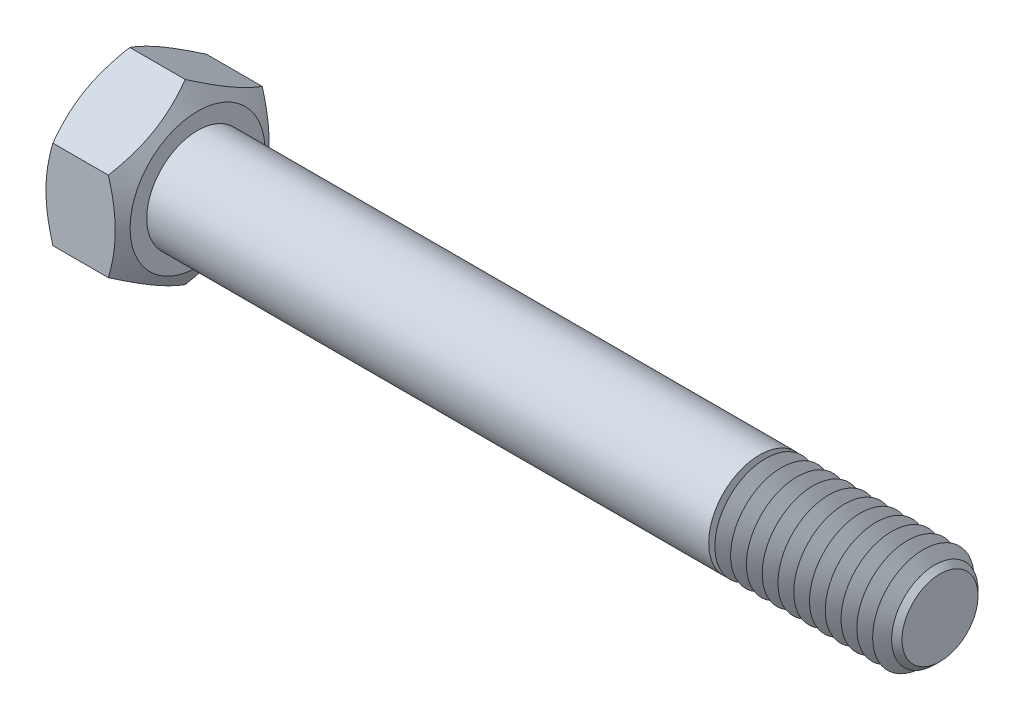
ISO-10303-21;
HEADER;
FILE_DESCRIPTION(('STEP AP214'),'2;1');
FILE_NAME('part.step','',(''),(''),'','','');
FILE_SCHEMA(('AUTOMOTIVE_DESIGN { 1 0 10303 214 1 1 1 1 }'));
ENDSEC;
DATA;
#1=APPLICATION_CONTEXT('core data for automotive mechanical design processes');
#2=APPLICATION_PROTOCOL_DEFINITION('international standard','automotive_design',2000,#1);
#3=PRODUCT_CONTEXT('',#1,'mechanical');
#4=PRODUCT('Part','Part','',(#3));
#5=PRODUCT_RELATED_PRODUCT_CATEGORY('part','',(#4));
#6=PRODUCT_DEFINITION_FORMATION('','',#4);
#7=PRODUCT_DEFINITION_CONTEXT('part definition',#1,'design');
#8=PRODUCT_DEFINITION('design','',#6,#7);
#9=PRODUCT_DEFINITION_SHAPE('','',#8);
#10=(LENGTH_UNIT() NAMED_UNIT(*) SI_UNIT(.MILLI.,.METRE.));
#11=(NAMED_UNIT(*) PLANE_ANGLE_UNIT() SI_UNIT($,.RADIAN.));
#12=(NAMED_UNIT(*) SI_UNIT($,.STERADIAN.) SOLID_ANGLE_UNIT());
#13=UNCERTAINTY_MEASURE_WITH_UNIT(LENGTH_MEASURE(1.E-05),#10,'distance_accuracy_value','');
#14=(GEOMETRIC_REPRESENTATION_CONTEXT(3) GLOBAL_UNCERTAINTY_ASSIGNED_CONTEXT((#13)) GLOBAL_UNIT_ASSIGNED_CONTEXT((#10,
#11,#12)) REPRESENTATION_CONTEXT('',''));
#15=CARTESIAN_POINT('',(0.,0.,0.));
#16=DIRECTION('',(0.,0.,1.));
#17=DIRECTION('',(1.,0.,0.));
#18=AXIS2_PLACEMENT_3D('',#15,#16,#17);
#19=CARTESIAN_POINT('',(103.320181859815,4.70606526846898,0.));
#20=DIRECTION('',(-1.,0.,0.));
#21=DIRECTION('',(0.,0.,1.));
#22=AXIS2_PLACEMENT_3D('',#19,#20,#21);
#23=PLANE('',#22);
#24=CARTESIAN_POINT('',(103.320181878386,0.,0.));
#25=DIRECTION('',(-1.,0.,0.));
#26=DIRECTION('',(0.,0.,1.));
#27=AXIS2_PLACEMENT_3D('',#24,#25,#26);
#28=CIRCLE('',#27,4.7060652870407);
#29=CARTESIAN_POINT('',(103.320181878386,0.,4.7060652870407));
#30=VERTEX_POINT('',#29);
#31=EDGE_CURVE('E19',#30,#30,#28,.T.);
#32=ORIENTED_EDGE('',*,*,#31,.F.);
#33=EDGE_LOOP('',(#32));
#34=FACE_BOUND('',#33,.T.);
#35=ADVANCED_FACE('F16',(#34),#23,.F.);
#36=CARTESIAN_POINT('',(102.677181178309,0.,0.));
#37=DIRECTION('',(-1.,0.,0.));
#38=DIRECTION('',(0.,0.,1.));
#39=AXIS2_PLACEMENT_3D('',#36,#37,#38);
#40=CONICAL_SURFACE('',#39,5.34906598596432,0.785398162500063);
#41=CARTESIAN_POINT('',(102.677181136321,0.,0.));
#42=DIRECTION('',(1.,0.,0.));
#43=DIRECTION('',(0.,0.,-1.));
#44=AXIS2_PLACEMENT_3D('',#41,#42,#43);
#45=CIRCLE('',#44,5.34906598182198);
#46=CARTESIAN_POINT('',(102.677181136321,0.,-5.34906598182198));
#47=VERTEX_POINT('',#46);
#48=EDGE_CURVE('E364',#47,#47,#45,.F.);
#49=ORIENTED_EDGE('',*,*,#48,.F.);
#50=EDGE_LOOP('',(#49));
#51=FACE_BOUND('',#50,.T.);
#52=ORIENTED_EDGE('',*,*,#31,.T.);
#53=EDGE_LOOP('',(#52));
#54=FACE_BOUND('',#53,.T.);
#55=ADVANCED_FACE('F374',(#51,#54),#40,.T.);
#56=CARTESIAN_POINT('',(102.677181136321,0.,0.));
#57=DIRECTION('',(1.,0.,0.));
#58=DIRECTION('',(0.,0.,-1.));
#59=AXIS2_PLACEMENT_3D('',#56,#57,#58);
#60=CONICAL_SURFACE('',#59,5.34906598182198,1.04719867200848);
#61=ORIENTED_EDGE('',*,*,#48,.T.);
#62=EDGE_LOOP('',(#61));
#63=FACE_BOUND('',#62,.T.);
#64=CARTESIAN_POINT('',(102.245567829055,0.,0.));
#65=DIRECTION('',(-1.,0.,0.));
#66=DIRECTION('',(0.,0.,1.));
#67=AXIS2_PLACEMENT_3D('',#64,#65,#66);
#68=CIRCLE('',#67,4.60148778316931);
#69=CARTESIAN_POINT('',(102.245567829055,0.,4.60148778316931));
#70=VERTEX_POINT('',#69);
#71=EDGE_CURVE('E359',#70,#70,#68,.T.);
#72=ORIENTED_EDGE('',*,*,#71,.F.);
#73=EDGE_LOOP('',(#72));
#74=FACE_BOUND('',#73,.T.);
#75=ADVANCED_FACE('F380',(#63,#74),#60,.T.);
#76=CARTESIAN_POINT('',(101.268640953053,0.,0.));
#77=DIRECTION('',(-1.,0.,0.));
#78=DIRECTION('',(0.,0.,1.));
#79=AXIS2_PLACEMENT_3D('',#76,#77,#78);
#80=CONICAL_SURFACE('',#79,6.29356599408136,1.04719530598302);
#81=CARTESIAN_POINT('',(101.268640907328,0.,0.));
#82=DIRECTION('',(1.,0.,0.));
#83=DIRECTION('',(0.,0.,-1.));
#84=AXIS2_PLACEMENT_3D('',#81,#82,#83);
#85=CIRCLE('',#84,6.29356599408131);
#86=CARTESIAN_POINT('',(101.268640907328,0.,-6.29356599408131));
#87=VERTEX_POINT('',#86);
#88=EDGE_CURVE('E354',#87,#87,#85,.F.);
#89=ORIENTED_EDGE('',*,*,#88,.F.);
#90=EDGE_LOOP('',(#89));
#91=FACE_BOUND('',#90,.T.);
#92=ORIENTED_EDGE('',*,*,#71,.T.);
#93=EDGE_LOOP('',(#92));
#94=FACE_BOUND('',#93,.T.);
#95=ADVANCED_FACE('F385',(#91,#94),#80,.T.);
#96=CARTESIAN_POINT('',(101.268640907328,0.,0.));
#97=DIRECTION('',(1.,0.,0.));
#98=DIRECTION('',(0.,0.,-1.));
#99=AXIS2_PLACEMENT_3D('',#96,#97,#98);
#100=CONICAL_SURFACE('',#99,6.29356599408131,1.04719867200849);
#101=ORIENTED_EDGE('',*,*,#88,.T.);
#102=EDGE_LOOP('',(#101));
#103=FACE_BOUND('',#102,.T.);
#104=CARTESIAN_POINT('',(100.291721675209,0.,0.));
#105=DIRECTION('',(-1.,0.,0.));
#106=DIRECTION('',(0.,0.,1.));
#107=AXIS2_PLACEMENT_3D('',#104,#105,#106);
#108=CIRCLE('',#107,4.60148778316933);
#109=CARTESIAN_POINT('',(100.291721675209,0.,4.60148778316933));
#110=VERTEX_POINT('',#109);
#111=EDGE_CURVE('E349',#110,#110,#108,.T.);
#112=ORIENTED_EDGE('',*,*,#111,.F.);
#113=EDGE_LOOP('',(#112));
#114=FACE_BOUND('',#113,.T.);
#115=ADVANCED_FACE('F390',(#103,#114),#100,.T.);
#116=CARTESIAN_POINT('',(99.3147947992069,0.,0.));
#117=DIRECTION('',(-1.,0.,0.));
#118=DIRECTION('',(0.,-1.,0.));
#119=AXIS2_PLACEMENT_3D('',#116,#117,#118);
#120=CONICAL_SURFACE('',#119,6.29356599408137,1.04719530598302);
#121=CARTESIAN_POINT('',(99.3147947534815,0.,0.));
#122=DIRECTION('',(1.,0.,0.));
#123=DIRECTION('',(0.,0.,-1.));
#124=AXIS2_PLACEMENT_3D('',#121,#122,#123);
#125=CIRCLE('',#124,6.29356599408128);
#126=CARTESIAN_POINT('',(99.3147947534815,0.,-6.29356599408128));
#127=VERTEX_POINT('',#126);
#128=EDGE_CURVE('E344',#127,#127,#125,.F.);
#129=ORIENTED_EDGE('',*,*,#128,.F.);
#130=EDGE_LOOP('',(#129));
#131=FACE_BOUND('',#130,.T.);
#132=ORIENTED_EDGE('',*,*,#111,.T.);
#133=EDGE_LOOP('',(#132));
#134=FACE_BOUND('',#133,.T.);
#135=ADVANCED_FACE('F394',(#131,#134),#120,.T.);
#136=CARTESIAN_POINT('',(99.3147947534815,0.,0.));
#137=DIRECTION('',(1.,0.,0.));
#138=DIRECTION('',(0.,0.,-1.));
#139=AXIS2_PLACEMENT_3D('',#136,#137,#138);
#140=CONICAL_SURFACE('',#139,6.29356599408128,1.04719867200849);
#141=ORIENTED_EDGE('',*,*,#128,.T.);
#142=EDGE_LOOP('',(#141));
#143=FACE_BOUND('',#142,.T.);
#144=CARTESIAN_POINT('',(98.3378755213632,0.,0.));
#145=DIRECTION('',(-1.,0.,0.));
#146=DIRECTION('',(0.,0.,1.));
#147=AXIS2_PLACEMENT_3D('',#144,#145,#146);
#148=CIRCLE('',#147,4.60148778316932);
#149=CARTESIAN_POINT('',(98.3378755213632,0.,4.60148778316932));
#150=VERTEX_POINT('',#149);
#151=EDGE_CURVE('E339',#150,#150,#148,.T.);
#152=ORIENTED_EDGE('',*,*,#151,.F.);
#153=EDGE_LOOP('',(#152));
#154=FACE_BOUND('',#153,.T.);
#155=ADVANCED_FACE('F398',(#143,#154),#140,.T.);
#156=CARTESIAN_POINT('',(97.3609486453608,0.,0.));
#157=DIRECTION('',(-1.,0.,0.));
#158=DIRECTION('',(0.,-1.,0.));
#159=AXIS2_PLACEMENT_3D('',#156,#157,#158);
#160=CONICAL_SURFACE('',#159,6.29356599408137,1.04719530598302);
#161=CARTESIAN_POINT('',(97.3609485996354,0.,0.));
#162=DIRECTION('',(1.,0.,0.));
#163=DIRECTION('',(0.,0.,-1.));
#164=AXIS2_PLACEMENT_3D('',#161,#162,#163);
#165=CIRCLE('',#164,6.29356599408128);
#166=CARTESIAN_POINT('',(97.3609485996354,0.,-6.29356599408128));
#167=VERTEX_POINT('',#166);
#168=EDGE_CURVE('E334',#167,#167,#165,.F.);
#169=ORIENTED_EDGE('',*,*,#168,.F.);
#170=EDGE_LOOP('',(#169));
#171=FACE_BOUND('',#170,.T.);
#172=ORIENTED_EDGE('',*,*,#151,.T.);
#173=EDGE_LOOP('',(#172));
#174=FACE_BOUND('',#173,.T.);
#175=ADVANCED_FACE('F402',(#171,#174),#160,.T.);
#176=CARTESIAN_POINT('',(97.3609485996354,0.,0.));
#177=DIRECTION('',(1.,0.,0.));
#178=DIRECTION('',(0.,1.,0.));
#179=AXIS2_PLACEMENT_3D('',#176,#177,#178);
#180=CONICAL_SURFACE('',#179,6.29356599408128,1.04719867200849);
#181=ORIENTED_EDGE('',*,*,#168,.T.);
#182=EDGE_LOOP('',(#181));
#183=FACE_BOUND('',#182,.T.);
#184=CARTESIAN_POINT('',(96.3840293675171,0.,0.));
#185=DIRECTION('',(-1.,0.,0.));
#186=DIRECTION('',(0.,0.,1.));
#187=AXIS2_PLACEMENT_3D('',#184,#185,#186);
#188=CIRCLE('',#187,4.60148778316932);
#189=CARTESIAN_POINT('',(96.3840293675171,0.,4.60148778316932));
#190=VERTEX_POINT('',#189);
#191=EDGE_CURVE('E329',#190,#190,#188,.T.);
#192=ORIENTED_EDGE('',*,*,#191,.F.);
#193=EDGE_LOOP('',(#192));
#194=FACE_BOUND('',#193,.T.);
#195=ADVANCED_FACE('F406',(#183,#194),#180,.T.);
#196=CARTESIAN_POINT('',(95.4071024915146,0.,0.));
#197=DIRECTION('',(-1.,0.,0.));
#198=DIRECTION('',(0.,0.,1.));
#199=AXIS2_PLACEMENT_3D('',#196,#197,#198);
#200=CONICAL_SURFACE('',#199,6.29356599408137,1.04719530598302);
#201=CARTESIAN_POINT('',(95.4071024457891,0.,0.));
#202=DIRECTION('',(1.,0.,0.));
#203=DIRECTION('',(0.,0.,-1.));
#204=AXIS2_PLACEMENT_3D('',#201,#202,#203);
#205=CIRCLE('',#204,6.2935659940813);
#206=CARTESIAN_POINT('',(95.4071024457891,0.,-6.2935659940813));
#207=VERTEX_POINT('',#206);
#208=EDGE_CURVE('E324',#207,#207,#205,.F.);
#209=ORIENTED_EDGE('',*,*,#208,.F.);
#210=EDGE_LOOP('',(#209));
#211=FACE_BOUND('',#210,.T.);
#212=ORIENTED_EDGE('',*,*,#191,.T.);
#213=EDGE_LOOP('',(#212));
#214=FACE_BOUND('',#213,.T.);
#215=ADVANCED_FACE('F410',(#211,#214),#200,.T.);
#216=CARTESIAN_POINT('',(95.4071024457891,0.,0.));
#217=DIRECTION('',(1.,0.,0.));
#218=DIRECTION('',(0.,1.,0.));
#219=AXIS2_PLACEMENT_3D('',#216,#217,#218);
#220=CONICAL_SURFACE('',#219,6.2935659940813,1.04719867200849);
#221=ORIENTED_EDGE('',*,*,#208,.T.);
#222=EDGE_LOOP('',(#221));
#223=FACE_BOUND('',#222,.T.);
#224=CARTESIAN_POINT('',(94.430183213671,0.,0.));
#225=DIRECTION('',(-1.,0.,0.));
#226=DIRECTION('',(0.,0.,1.));
#227=AXIS2_PLACEMENT_3D('',#224,#225,#226);
#228=CIRCLE('',#227,4.60148778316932);
#229=CARTESIAN_POINT('',(94.430183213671,0.,4.60148778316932));
#230=VERTEX_POINT('',#229);
#231=EDGE_CURVE('E319',#230,#230,#228,.T.);
#232=ORIENTED_EDGE('',*,*,#231,.F.);
#233=EDGE_LOOP('',(#232));
#234=FACE_BOUND('',#233,.T.);
#235=ADVANCED_FACE('F414',(#223,#234),#220,.T.);
#236=CARTESIAN_POINT('',(93.4532563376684,0.,0.));
#237=DIRECTION('',(-1.,0.,0.));
#238=DIRECTION('',(0.,-1.,0.));
#239=AXIS2_PLACEMENT_3D('',#236,#237,#238);
#240=CONICAL_SURFACE('',#239,6.29356599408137,1.04719530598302);
#241=CARTESIAN_POINT('',(93.453256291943,0.,0.));
#242=DIRECTION('',(1.,0.,0.));
#243=DIRECTION('',(0.,0.,-1.));
#244=AXIS2_PLACEMENT_3D('',#241,#242,#243);
#245=CIRCLE('',#244,6.2935659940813);
#246=CARTESIAN_POINT('',(93.453256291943,0.,-6.2935659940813));
#247=VERTEX_POINT('',#246);
#248=EDGE_CURVE('E314',#247,#247,#245,.F.);
#249=ORIENTED_EDGE('',*,*,#248,.F.);
#250=EDGE_LOOP('',(#249));
#251=FACE_BOUND('',#250,.T.);
#252=ORIENTED_EDGE('',*,*,#231,.T.);
#253=EDGE_LOOP('',(#252));
#254=FACE_BOUND('',#253,.T.);
#255=ADVANCED_FACE('F418',(#251,#254),#240,.T.);
#256=CARTESIAN_POINT('',(93.453256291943,0.,0.));
#257=DIRECTION('',(1.,0.,0.));
#258=DIRECTION('',(0.,0.,-1.));
#259=AXIS2_PLACEMENT_3D('',#256,#257,#258);
#260=CONICAL_SURFACE('',#259,6.2935659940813,1.04719867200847);
#261=ORIENTED_EDGE('',*,*,#248,.T.);
#262=EDGE_LOOP('',(#261));
#263=FACE_BOUND('',#262,.T.);
#264=CARTESIAN_POINT('',(92.4763370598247,0.,0.));
#265=DIRECTION('',(-1.,0.,0.));
#266=DIRECTION('',(0.,0.,1.));
#267=AXIS2_PLACEMENT_3D('',#264,#265,#266);
#268=CIRCLE('',#267,4.60148778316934);
#269=CARTESIAN_POINT('',(92.4763370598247,0.,4.60148778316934));
#270=VERTEX_POINT('',#269);
#271=EDGE_CURVE('E309',#270,#270,#268,.T.);
#272=ORIENTED_EDGE('',*,*,#271,.F.);
#273=EDGE_LOOP('',(#272));
#274=FACE_BOUND('',#273,.T.);
#275=ADVANCED_FACE('F422',(#263,#274),#260,.T.);
#276=CARTESIAN_POINT('',(91.4994101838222,0.,0.));
#277=DIRECTION('',(-1.,0.,0.));
#278=DIRECTION('',(0.,0.,1.));
#279=AXIS2_PLACEMENT_3D('',#276,#277,#278);
#280=CONICAL_SURFACE('',#279,6.29356599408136,1.04719530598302);
#281=CARTESIAN_POINT('',(91.4994101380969,0.,0.));
#282=DIRECTION('',(1.,0.,0.));
#283=DIRECTION('',(0.,0.,-1.));
#284=AXIS2_PLACEMENT_3D('',#281,#282,#283);
#285=CIRCLE('',#284,6.29356599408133);
#286=CARTESIAN_POINT('',(91.4994101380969,0.,-6.29356599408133));
#287=VERTEX_POINT('',#286);
#288=EDGE_CURVE('E304',#287,#287,#285,.F.);
#289=ORIENTED_EDGE('',*,*,#288,.F.);
#290=EDGE_LOOP('',(#289));
#291=FACE_BOUND('',#290,.T.);
#292=ORIENTED_EDGE('',*,*,#271,.T.);
#293=EDGE_LOOP('',(#292));
#294=FACE_BOUND('',#293,.T.);
#295=ADVANCED_FACE('F426',(#291,#294),#280,.T.);
#296=CARTESIAN_POINT('',(91.4994101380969,0.,0.));
#297=DIRECTION('',(1.,0.,0.));
#298=DIRECTION('',(0.,0.,-1.));
#299=AXIS2_PLACEMENT_3D('',#296,#297,#298);
#300=CONICAL_SURFACE('',#299,6.29356599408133,1.04719867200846);
#301=ORIENTED_EDGE('',*,*,#288,.T.);
#302=EDGE_LOOP('',(#301));
#303=FACE_BOUND('',#302,.T.);
#304=CARTESIAN_POINT('',(90.5224909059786,0.,0.));
#305=DIRECTION('',(-1.,0.,0.));
#306=DIRECTION('',(0.,0.,1.));
#307=AXIS2_PLACEMENT_3D('',#304,#305,#306);
#308=CIRCLE('',#307,4.60148778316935);
#309=CARTESIAN_POINT('',(90.5224909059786,0.,4.60148778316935));
#310=VERTEX_POINT('',#309);
#311=EDGE_CURVE('E299',#310,#310,#308,.T.);
#312=ORIENTED_EDGE('',*,*,#311,.F.);
#313=EDGE_LOOP('',(#312));
#314=FACE_BOUND('',#313,.T.);
#315=ADVANCED_FACE('F430',(#303,#314),#300,.T.);
#316=CARTESIAN_POINT('',(89.5455640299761,0.,0.));
#317=DIRECTION('',(-1.,0.,0.));
#318=DIRECTION('',(0.,0.,1.));
#319=AXIS2_PLACEMENT_3D('',#316,#317,#318);
#320=CONICAL_SURFACE('',#319,6.29356599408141,1.04719530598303);
#321=CARTESIAN_POINT('',(89.5455639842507,0.,0.));
#322=DIRECTION('',(1.,0.,0.));
#323=DIRECTION('',(0.,0.,-1.));
#324=AXIS2_PLACEMENT_3D('',#321,#322,#323);
#325=CIRCLE('',#324,6.29356599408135);
#326=CARTESIAN_POINT('',(89.5455639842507,0.,-6.29356599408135));
#327=VERTEX_POINT('',#326);
#328=EDGE_CURVE('E294',#327,#327,#325,.F.);
#329=ORIENTED_EDGE('',*,*,#328,.F.);
#330=EDGE_LOOP('',(#329));
#331=FACE_BOUND('',#330,.T.);
#332=ORIENTED_EDGE('',*,*,#311,.T.);
#333=EDGE_LOOP('',(#332));
#334=FACE_BOUND('',#333,.T.);
#335=ADVANCED_FACE('F434',(#331,#334),#320,.T.);
#336=CARTESIAN_POINT('',(89.5455639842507,0.,0.));
#337=DIRECTION('',(1.,0.,0.));
#338=DIRECTION('',(0.,0.,-1.));
#339=AXIS2_PLACEMENT_3D('',#336,#337,#338);
#340=CONICAL_SURFACE('',#339,6.29356599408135,1.04719867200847);
#341=ORIENTED_EDGE('',*,*,#328,.T.);
#342=EDGE_LOOP('',(#341));
#343=FACE_BOUND('',#342,.T.);
#344=CARTESIAN_POINT('',(88.5686447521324,0.,0.));
#345=DIRECTION('',(-1.,0.,0.));
#346=DIRECTION('',(0.,0.,1.));
#347=AXIS2_PLACEMENT_3D('',#344,#345,#346);
#348=CIRCLE('',#347,4.60148778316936);
#349=CARTESIAN_POINT('',(88.5686447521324,0.,4.60148778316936));
#350=VERTEX_POINT('',#349);
#351=EDGE_CURVE('E289',#350,#350,#348,.T.);
#352=ORIENTED_EDGE('',*,*,#351,.F.);
#353=EDGE_LOOP('',(#352));
#354=FACE_BOUND('',#353,.T.);
#355=ADVANCED_FACE('F438',(#343,#354),#340,.T.);
#356=CARTESIAN_POINT('',(87.5917178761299,0.,0.));
#357=DIRECTION('',(-1.,0.,0.));
#358=DIRECTION('',(0.,-1.,0.));
#359=AXIS2_PLACEMENT_3D('',#356,#357,#358);
#360=CONICAL_SURFACE('',#359,6.29356599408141,1.04719530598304);
#361=CARTESIAN_POINT('',(87.5917178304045,0.,0.));
#362=DIRECTION('',(1.,0.,0.));
#363=DIRECTION('',(0.,0.,-1.));
#364=AXIS2_PLACEMENT_3D('',#361,#362,#363);
#365=CIRCLE('',#364,6.29356599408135);
#366=CARTESIAN_POINT('',(87.5917178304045,0.,-6.29356599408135));
#367=VERTEX_POINT('',#366);
#368=EDGE_CURVE('E284',#367,#367,#365,.F.);
#369=ORIENTED_EDGE('',*,*,#368,.F.);
#370=EDGE_LOOP('',(#369));
#371=FACE_BOUND('',#370,.T.);
#372=ORIENTED_EDGE('',*,*,#351,.T.);
#373=EDGE_LOOP('',(#372));
#374=FACE_BOUND('',#373,.T.);
#375=ADVANCED_FACE('F442',(#371,#374),#360,.T.);
#376=CARTESIAN_POINT('',(48.5345694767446,0.,0.));
#377=DIRECTION('',(-1.,0.,0.));
#378=DIRECTION('',(0.,-1.,0.));
#379=AXIS2_PLACEMENT_3D('',#376,#377,#378);
#380=CONICAL_SURFACE('',#379,2.25496528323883,1.10162930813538);
#381=CARTESIAN_POINT('',(49.6776529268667,0.,0.));
#382=VERTEX_POINT('',#381);
#383=VERTEX_LOOP('',#382);
#384=FACE_BOUND('',#383,.T.);
#385=CARTESIAN_POINT('',(48.5345694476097,0.,0.));
#386=DIRECTION('',(-1.,0.,0.));
#387=DIRECTION('',(0.,0.,1.));
#388=AXIS2_PLACEMENT_3D('',#385,#386,#387);
#389=CIRCLE('',#388,2.25496526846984);
#390=CARTESIAN_POINT('',(48.5345694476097,0.,2.25496526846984));
#391=VERTEX_POINT('',#390);
#392=EDGE_CURVE('E279',#391,#391,#389,.T.);
#393=ORIENTED_EDGE('',*,*,#392,.T.);
#394=EDGE_LOOP('',(#393));
#395=FACE_BOUND('',#394,.T.);
#396=ADVANCED_FACE('F446',(#384,#395),#380,.F.);
#397=CARTESIAN_POINT('',(87.5917178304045,0.,0.));
#398=DIRECTION('',(1.,0.,0.));
#399=DIRECTION('',(0.,1.,0.));
#400=AXIS2_PLACEMENT_3D('',#397,#398,#399);
#401=CONICAL_SURFACE('',#400,6.29356599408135,1.04719867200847);
#402=ORIENTED_EDGE('',*,*,#368,.T.);
#403=EDGE_LOOP('',(#402));
#404=FACE_BOUND('',#403,.T.);
#405=CARTESIAN_POINT('',(86.6147985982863,0.,0.));
#406=DIRECTION('',(-1.,0.,0.));
#407=DIRECTION('',(0.,0.,1.));
#408=AXIS2_PLACEMENT_3D('',#405,#406,#407);
#409=CIRCLE('',#408,4.6014877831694);
#410=CARTESIAN_POINT('',(86.6147985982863,0.,4.6014877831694));
#411=VERTEX_POINT('',#410);
#412=EDGE_CURVE('E274',#411,#411,#409,.T.);
#413=ORIENTED_EDGE('',*,*,#412,.F.);
#414=EDGE_LOOP('',(#413));
#415=FACE_BOUND('',#414,.T.);
#416=ADVANCED_FACE('F450',(#404,#415),#401,.T.);
#417=CARTESIAN_POINT('',(0.,0.,0.));
#418=DIRECTION('',(-1.,0.,0.));
#419=DIRECTION('',(0.,0.,1.));
#420=AXIS2_PLACEMENT_3D('',#417,#418,#419);
#421=CYLINDRICAL_SURFACE('',#420,2.25496526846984);
#422=CARTESIAN_POINT('',(7.86083723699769,0.,0.));
#423=DIRECTION('',(-1.,0.,0.));
#424=DIRECTION('',(0.,0.,1.));
#425=AXIS2_PLACEMENT_3D('',#422,#423,#424);
#426=CIRCLE('',#425,2.25496528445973);
#427=CARTESIAN_POINT('',(7.86083723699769,0.,2.25496528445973));
#428=VERTEX_POINT('',#427);
#429=EDGE_CURVE('E269',#428,#428,#426,.T.);
#430=ORIENTED_EDGE('',*,*,#429,.T.);
#431=EDGE_LOOP('',(#430));
#432=FACE_BOUND('',#431,.T.);
#433=ORIENTED_EDGE('',*,*,#392,.F.);
#434=EDGE_LOOP('',(#433));
#435=FACE_BOUND('',#434,.T.);
#436=ADVANCED_FACE('F454',(#432,#435),#421,.F.);
#437=CARTESIAN_POINT('',(85.6378717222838,0.,0.));
#438=DIRECTION('',(-1.,0.,0.));
#439=DIRECTION('',(0.,0.,1.));
#440=AXIS2_PLACEMENT_3D('',#437,#438,#439);
#441=CONICAL_SURFACE('',#440,6.29356599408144,1.04719530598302);
#442=CARTESIAN_POINT('',(85.6378716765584,0.,0.));
#443=DIRECTION('',(1.,0.,0.));
#444=DIRECTION('',(0.,0.,-1.));
#445=AXIS2_PLACEMENT_3D('',#442,#443,#444);
#446=CIRCLE('',#445,6.29356599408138);
#447=CARTESIAN_POINT('',(85.6378716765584,0.,-6.29356599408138));
#448=VERTEX_POINT('',#447);
#449=EDGE_CURVE('E264',#448,#448,#446,.F.);
#450=ORIENTED_EDGE('',*,*,#449,.F.);
#451=EDGE_LOOP('',(#450));
#452=FACE_BOUND('',#451,.T.);
#453=ORIENTED_EDGE('',*,*,#412,.T.);
#454=EDGE_LOOP('',(#453));
#455=FACE_BOUND('',#454,.T.);
#456=ADVANCED_FACE('F458',(#452,#455),#441,.T.);
#457=CARTESIAN_POINT('',(4.61260688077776,0.,0.));
#458=DIRECTION('',(-1.,0.,0.));
#459=DIRECTION('',(0.,0.,1.));
#460=AXIS2_PLACEMENT_3D('',#457,#458,#459);
#461=CONICAL_SURFACE('',#460,7.8810652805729,1.04719755);
#462=CARTESIAN_POINT('',(4.61260685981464,0.,0.));
#463=DIRECTION('',(-1.,0.,0.));
#464=DIRECTION('',(0.,0.,1.));
#465=AXIS2_PLACEMENT_3D('',#462,#463,#464);
#466=CIRCLE('',#465,7.88106526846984);
#467=CARTESIAN_POINT('',(4.61260685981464,0.,7.88106531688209));
#468=VERTEX_POINT('',#467);
#469=EDGE_CURVE('E259',#468,#468,#466,.T.);
#470=CARTESIAN_POINT('',(4.61260685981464,0.,7.88106531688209));
#471=CARTESIAN_POINT('',(4.6464425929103,0.,7.82246010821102));
#472=CARTESIAN_POINT('',(4.68027832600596,0.,7.76385489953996));
#473=CARTESIAN_POINT('',(4.74794979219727,0.,7.64664448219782));
#474=CARTESIAN_POINT('',(4.78178552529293,0.,7.58803927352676));
#475=CARTESIAN_POINT('',(4.84945699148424,0.,7.47082885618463));
#476=CARTESIAN_POINT('',(4.8832927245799,0.,7.41222364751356));
#477=CARTESIAN_POINT('',(4.95096419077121,0.,7.29501323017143));
#478=CARTESIAN_POINT('',(4.98479992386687,0.,7.23640802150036));
#479=CARTESIAN_POINT('',(5.05247139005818,0.,7.11919760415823));
#480=CARTESIAN_POINT('',(5.08630712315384,0.,7.06059239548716));
#481=CARTESIAN_POINT('',(5.15397858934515,0.,6.94338197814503));
#482=CARTESIAN_POINT('',(5.18781432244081,0.,6.88477676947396));
#483=CARTESIAN_POINT('',(5.25548578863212,0.,6.76756635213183));
#484=CARTESIAN_POINT('',(5.28932152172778,0.,6.70896114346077));
#485=CARTESIAN_POINT('',(5.35699298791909,0.,6.59175072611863));
#486=CARTESIAN_POINT('',(5.39082872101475,0.,6.53314551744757));
#487=CARTESIAN_POINT('',(5.45850018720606,0.,6.41593510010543));
#488=CARTESIAN_POINT('',(5.49233592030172,0.,6.35732989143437));
#489=CARTESIAN_POINT('',(5.56000738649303,0.,6.24011947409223));
#490=CARTESIAN_POINT('',(5.59384311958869,0.,6.18151426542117));
#491=CARTESIAN_POINT('',(5.66151458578,0.,6.06430384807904));
#492=CARTESIAN_POINT('',(5.69535031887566,0.,6.00569863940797));
#493=CARTESIAN_POINT('',(5.76302178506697,0.,5.88848822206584));
#494=CARTESIAN_POINT('',(5.79685751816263,0.,5.82988301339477));
#495=CARTESIAN_POINT('',(5.86452898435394,0.,5.71267259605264));
#496=CARTESIAN_POINT('',(5.8983647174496,0.,5.65406738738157));
#497=CARTESIAN_POINT('',(5.96603618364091,0.,5.53685697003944));
#498=CARTESIAN_POINT('',(5.99987191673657,0.,5.47825176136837));
#499=CARTESIAN_POINT('',(6.06754338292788,0.,5.36104134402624));
#500=CARTESIAN_POINT('',(6.10137911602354,0.,5.30243613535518));
#501=CARTESIAN_POINT('',(6.16905058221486,0.,5.18522571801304));
#502=CARTESIAN_POINT('',(6.20288631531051,0.,5.12662050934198));
#503=CARTESIAN_POINT('',(6.27055778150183,0.,5.00941009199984));
#504=CARTESIAN_POINT('',(6.30439351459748,0.,4.95080488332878));
#505=CARTESIAN_POINT('',(6.3720649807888,0.,4.83359446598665));
#506=CARTESIAN_POINT('',(6.40590071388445,0.,4.77498925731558));
#507=CARTESIAN_POINT('',(6.47357218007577,0.,4.65777883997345));
#508=CARTESIAN_POINT('',(6.50740791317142,0.,4.59917363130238));
#509=CARTESIAN_POINT('',(6.57507937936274,0.,4.48196321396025));
#510=CARTESIAN_POINT('',(6.60891511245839,0.,4.42335800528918));
#511=CARTESIAN_POINT('',(6.67658657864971,0.,4.30614758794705));
#512=CARTESIAN_POINT('',(6.71042231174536,0.,4.24754237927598));
#513=CARTESIAN_POINT('',(6.77809377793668,0.,4.13033196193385));
#514=CARTESIAN_POINT('',(6.81192951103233,0.,4.07172675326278));
#515=CARTESIAN_POINT('',(6.87960097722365,0.,3.95451633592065));
#516=CARTESIAN_POINT('',(6.9134367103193,0.,3.89591112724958));
#517=CARTESIAN_POINT('',(6.98110817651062,0.,3.77870070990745));
#518=CARTESIAN_POINT('',(7.01494390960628,0.,3.72009550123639));
#519=CARTESIAN_POINT('',(7.08261537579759,0.,3.60288508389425));
#520=CARTESIAN_POINT('',(7.11645110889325,0.,3.54427987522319));
#521=CARTESIAN_POINT('',(7.18412257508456,0.,3.42706945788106));
#522=CARTESIAN_POINT('',(7.21795830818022,0.,3.36846424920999));
#523=CARTESIAN_POINT('',(7.28562977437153,0.,3.25125383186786));
#524=CARTESIAN_POINT('',(7.31946550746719,0.,3.19264862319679));
#525=CARTESIAN_POINT('',(7.3871369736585,0.,3.07543820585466));
#526=CARTESIAN_POINT('',(7.42097270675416,0.,3.01683299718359));
#527=CARTESIAN_POINT('',(7.48864417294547,0.,2.89962257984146));
#528=CARTESIAN_POINT('',(7.52247990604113,0.,2.84101737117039));
#529=CARTESIAN_POINT('',(7.59015137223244,0.,2.72380695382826));
#530=CARTESIAN_POINT('',(7.6239871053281,0.,2.66520174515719));
#531=CARTESIAN_POINT('',(7.69165857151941,0.,2.54799132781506));
#532=CARTESIAN_POINT('',(7.72549430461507,0.,2.489386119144));
#533=CARTESIAN_POINT('',(7.79316577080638,0.,2.37217570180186));
#534=CARTESIAN_POINT('',(7.82700150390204,0.,2.3135704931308));
#535=CARTESIAN_POINT('',(7.86083723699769,0.,2.25496528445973));
#536=B_SPLINE_CURVE_WITH_KNOTS('',3,(#470,#471,#472,#473,#474,#475,#476,#477,#478,#479,#480,
#481,#482,#483,#484,#485,#486,#487,#488,#489,#490,#491,#492,#493,#494,#495,#496,#497,#498,#499,
#500,#501,#502,#503,#504,#505,#506,#507,#508,#509,#510,#511,#512,#513,#514,#515,#516,#517,#518,
#519,#520,#521,#522,#523,#524,#525,#526,#527,#528,#529,#530,#531,#532,#533,#534,#535),
.UNSPECIFIED.,.F.,.F.,(4,2,2,2,2,2,2,2,2,2,2,2,2,2,2,2,2,2,2,2,2,2,2,2,2,2,2,2,2,2,2,2,4),(0.,
0.203014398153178,0.406028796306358,0.609043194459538,0.812057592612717,1.0150719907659,
1.21808638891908,1.42110078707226,1.62411518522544,1.82712958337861,2.03014398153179,
2.23315837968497,2.43617277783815,2.63918717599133,2.84220157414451,3.04521597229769,
3.24823037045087,3.45124476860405,3.65425916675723,3.85727356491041,4.06028796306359,
4.26330236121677,4.46631675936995,4.66933115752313,4.87234555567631,5.07535995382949,
5.27837435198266,5.48138875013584,5.68440314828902,5.8874175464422,6.09043194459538,
6.29344634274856,6.49646074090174),.UNSPECIFIED.);
#537=EDGE_CURVE('BSEAM462',#468,#428,#536,.T.);
#538=ORIENTED_EDGE('',*,*,#469,.T.);
#539=ORIENTED_EDGE('',*,*,#429,.F.);
#540=ORIENTED_EDGE('',*,*,#537,.T.);
#541=ORIENTED_EDGE('',*,*,#537,.F.);
#542=EDGE_LOOP('',(#538,#540,#539,#541));
#543=FACE_BOUND('',#542,.T.);
#544=ADVANCED_FACE('F462',(#543),#461,.F.);
#545=CARTESIAN_POINT('',(85.6378716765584,0.,0.));
#546=DIRECTION('',(1.,0.,0.));
#547=DIRECTION('',(0.,0.,-1.));
#548=AXIS2_PLACEMENT_3D('',#545,#546,#547);
#549=CONICAL_SURFACE('',#548,6.29356599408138,1.04719867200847);
#550=ORIENTED_EDGE('',*,*,#449,.T.);
#551=EDGE_LOOP('',(#550));
#552=FACE_BOUND('',#551,.T.);
#553=CARTESIAN_POINT('',(84.6609524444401,0.,0.));
#554=DIRECTION('',(-1.,0.,0.));
#555=DIRECTION('',(0.,0.,1.));
#556=AXIS2_PLACEMENT_3D('',#553,#554,#555);
#557=CIRCLE('',#556,4.60148778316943);
#558=CARTESIAN_POINT('',(84.6609524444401,0.,4.60148778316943));
#559=VERTEX_POINT('',#558);
#560=EDGE_CURVE('E256',#559,#559,#557,.T.);
#561=ORIENTED_EDGE('',*,*,#560,.F.);
#562=EDGE_LOOP('',(#561));
#563=FACE_BOUND('',#562,.T.);
#564=ADVANCED_FACE('F466',(#552,#563),#549,.T.);
#565=CARTESIAN_POINT('',(0.,0.,0.));
#566=DIRECTION('',(-1.,0.,0.));
#567=DIRECTION('',(0.,0.,1.));
#568=AXIS2_PLACEMENT_3D('',#565,#566,#567);
#569=CYLINDRICAL_SURFACE('',#568,7.88106526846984);
#570=CARTESIAN_POINT('',(1.45030685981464,0.,0.));
#571=DIRECTION('',(-1.,0.,0.));
#572=DIRECTION('',(0.,0.,1.));
#573=AXIS2_PLACEMENT_3D('',#570,#571,#572);
#574=CIRCLE('',#573,7.88106526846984);
#575=CARTESIAN_POINT('',(1.45030685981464,0.,7.88106526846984));
#576=VERTEX_POINT('',#575);
#577=EDGE_CURVE('E253',#576,#576,#574,.T.);
#578=ORIENTED_EDGE('',*,*,#577,.T.);
#579=EDGE_LOOP('',(#578));
#580=FACE_BOUND('',#579,.T.);
#581=ORIENTED_EDGE('',*,*,#469,.F.);
#582=EDGE_LOOP('',(#581));
#583=FACE_BOUND('',#582,.T.);
#584=ADVANCED_FACE('F470',(#580,#583),#569,.F.);
#585=CARTESIAN_POINT('',(83.6840255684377,0.,0.));
#586=DIRECTION('',(-1.,0.,0.));
#587=DIRECTION('',(0.,0.,1.));
#588=AXIS2_PLACEMENT_3D('',#585,#586,#587);
#589=CONICAL_SURFACE('',#588,6.29356599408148,1.04719530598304);
#590=CARTESIAN_POINT('',(83.6840255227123,0.,0.));
#591=DIRECTION('',(1.,0.,0.));
#592=DIRECTION('',(0.,0.,-1.));
#593=AXIS2_PLACEMENT_3D('',#590,#591,#592);
#594=CIRCLE('',#593,6.29356599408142);
#595=CARTESIAN_POINT('',(83.6840255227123,0.,-6.29356599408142));
#596=VERTEX_POINT('',#595);
#597=EDGE_CURVE('E250',#596,#596,#594,.F.);
#598=ORIENTED_EDGE('',*,*,#597,.F.);
#599=EDGE_LOOP('',(#598));
#600=FACE_BOUND('',#599,.T.);
#601=ORIENTED_EDGE('',*,*,#560,.T.);
#602=EDGE_LOOP('',(#601));
#603=FACE_BOUND('',#602,.T.);
#604=ADVANCED_FACE('F474',(#600,#603),#589,.T.);
#605=CARTESIAN_POINT('',(1.45030685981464,7.88106526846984,0.));
#606=DIRECTION('',(1.,0.,0.));
#607=DIRECTION('',(0.,0.,-1.));
#608=AXIS2_PLACEMENT_3D('',#605,#606,#607);
#609=PLANE('',#608);
#610=ORIENTED_EDGE('',*,*,#577,.F.);
#611=EDGE_LOOP('',(#610));
#612=FACE_BOUND('',#611,.T.);
#613=CARTESIAN_POINT('',(1.45030683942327,0.,0.));
#614=DIRECTION('',(1.,0.,0.));
#615=DIRECTION('',(0.,0.,-1.));
#616=AXIS2_PLACEMENT_3D('',#613,#614,#615);
#617=CIRCLE('',#616,8.35887720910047);
#618=CARTESIAN_POINT('',(1.45030683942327,0.,-8.35887720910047));
#619=VERTEX_POINT('',#618);
#620=EDGE_CURVE('E247',#619,#619,#617,.T.);
#621=ORIENTED_EDGE('',*,*,#620,.F.);
#622=EDGE_LOOP('',(#621));
#623=FACE_BOUND('',#622,.T.);
#624=ADVANCED_FACE('F477',(#612,#623),#609,.F.);
#625=CARTESIAN_POINT('',(83.6840255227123,0.,0.));
#626=DIRECTION('',(1.,0.,0.));
#627=DIRECTION('',(0.,0.,-1.));
#628=AXIS2_PLACEMENT_3D('',#625,#626,#627);
#629=CONICAL_SURFACE('',#628,6.29356599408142,1.04719867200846);
#630=ORIENTED_EDGE('',*,*,#597,.T.);
#631=EDGE_LOOP('',(#630));
#632=FACE_BOUND('',#631,.T.);
#633=CARTESIAN_POINT('',(82.7071062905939,0.,0.));
#634=DIRECTION('',(-1.,0.,0.));
#635=DIRECTION('',(0.,0.,1.));
#636=AXIS2_PLACEMENT_3D('',#633,#634,#635);
#637=CIRCLE('',#636,4.60148778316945);
#638=CARTESIAN_POINT('',(82.7071062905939,0.,4.60148778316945));
#639=VERTEX_POINT('',#638);
#640=EDGE_CURVE('E81',#639,#639,#637,.T.);
#641=ORIENTED_EDGE('',*,*,#640,.F.);
#642=EDGE_LOOP('',(#641));
#643=FACE_BOUND('',#642,.T.);
#644=ADVANCED_FACE('F121',(#632,#643),#629,.T.);
#645=CARTESIAN_POINT('',(2.98345084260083,0.,0.));
#646=DIRECTION('',(1.,0.,0.));
#647=DIRECTION('',(0.,0.,-1.));
#648=AXIS2_PLACEMENT_3D('',#645,#646,#647);
#649=CONICAL_SURFACE('',#648,11.0143605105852,1.04719754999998);
#650=CARTESIAN_POINT('',(2.97430684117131,5.49926131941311,9.52499999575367));
#651=CARTESIAN_POINT('',(2.90452744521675,5.25749169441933,9.52499999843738));
#652=CARTESIAN_POINT('',(2.83791530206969,5.01482062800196,9.52499999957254));
#653=CARTESIAN_POINT('',(2.71190430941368,4.52753247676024,9.5250000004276));
#654=CARTESIAN_POINT('',(2.65250783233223,4.28291477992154,9.52500000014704));
#655=CARTESIAN_POINT('',(2.48629143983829,3.54512034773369,9.52499999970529));
#656=CARTESIAN_POINT('',(2.39174942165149,3.04903113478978,9.52499999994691));
#657=CARTESIAN_POINT('',(2.2808920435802,2.30665638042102,9.52500000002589));
#658=CARTESIAN_POINT('',(2.24931333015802,2.06258858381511,9.52500000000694));
#659=CARTESIAN_POINT('',(2.19635878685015,1.57332307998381,9.52499999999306));
#660=CARTESIAN_POINT('',(2.1749831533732,1.32812535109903,9.52499999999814));
#661=CARTESIAN_POINT('',(2.14298246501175,0.837320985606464,9.52500000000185));
#662=CARTESIAN_POINT('',(2.13234463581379,0.59171518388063,9.52500000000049));
#663=CARTESIAN_POINT('',(2.12204559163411,0.100276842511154,9.52499999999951));
#664=CARTESIAN_POINT('',(2.12238403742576,-0.145555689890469,9.52499999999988));
#665=CARTESIAN_POINT('',(2.13327316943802,-0.605130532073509,9.52500000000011));
#666=CARTESIAN_POINT('',(2.1424955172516,-0.818905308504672,9.52500000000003));
#667=CARTESIAN_POINT('',(2.16906151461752,-1.24595486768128,9.52499999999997));
#668=CARTESIAN_POINT('',(2.18640573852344,-1.45922961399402,9.52499999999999));
#669=CARTESIAN_POINT('',(2.25021122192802,-2.09822742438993,9.52500000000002));
#670=CARTESIAN_POINT('',(2.3084373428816,-2.5228194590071,9.52500000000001));
#671=CARTESIAN_POINT('',(2.4540006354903,-3.37650682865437,9.52499999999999));
#672=CARTESIAN_POINT('',(2.54195471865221,-3.80549323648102,9.525));
#673=CARTESIAN_POINT('',(2.74157298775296,-4.65706950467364,9.525));
#674=CARTESIAN_POINT('',(2.85319030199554,-5.07967026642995,9.52500000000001));
#675=CARTESIAN_POINT('',(2.97430683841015,-5.49926131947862,9.525));
#676=B_SPLINE_CURVE_WITH_KNOTS('',3,(#650,#651,#652,#653,#654,#655,#656,#657,#658,#659,#660,
#661,#662,#663,#664,#665,#666,#667,#668,#669,#670,#671,#672,#673,#674,#675),.UNSPECIFIED.,.F.,
.F.,(4,2,2,2,2,2,2,2,2,2,2,2,4),(0.,0.754853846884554,1.50995521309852,3.02337201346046,
3.76150688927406,4.4996559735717,5.23692587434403,5.97417298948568,6.61593390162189,
7.25774020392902,8.54226461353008,9.85527361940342,11.1657057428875),.UNSPECIFIED.);
#677=CARTESIAN_POINT('',(2.97430683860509,5.49926131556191,9.52500000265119));
#678=VERTEX_POINT('',#677);
#679=CARTESIAN_POINT('',(2.9743068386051,-5.49926131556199,9.52500000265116));
#680=VERTEX_POINT('',#679);
#681=EDGE_CURVE('E94',#678,#680,#676,.T.);
#682=ORIENTED_EDGE('',*,*,#681,.F.);
#683=CARTESIAN_POINT('',(2.9743068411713,10.998522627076,-6.78398877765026E-09));
#684=CARTESIAN_POINT('',(2.90452744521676,10.8776378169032,0.209378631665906));
#685=CARTESIAN_POINT('',(2.8379153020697,10.7563022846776,0.419537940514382));
#686=CARTESIAN_POINT('',(2.7119043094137,10.5126582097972,0.841541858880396));
#687=CARTESIAN_POINT('',(2.65250783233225,10.3903493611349,1.05338699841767));
#688=CARTESIAN_POINT('',(2.48629143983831,10.0214521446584,1.69233571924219));
#689=CARTESIAN_POINT('',(2.39174942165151,9.77340753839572,2.12196158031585));
#690=CARTESIAN_POINT('',(2.28089204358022,9.40222016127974,2.76487697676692));
#691=CARTESIAN_POINT('',(2.24931333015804,9.28018626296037,2.97624588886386));
#692=CARTESIAN_POINT('',(2.19635878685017,9.03555351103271,3.39996224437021));
#693=CARTESIAN_POINT('',(2.17498315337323,8.91295464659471,3.61230970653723));
#694=CARTESIAN_POINT('',(2.14298246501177,8.66755246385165,4.03735875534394));
#695=CARTESIAN_POINT('',(2.13234463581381,8.54474956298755,4.25005961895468));
#696=CARTESIAN_POINT('',(2.12204559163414,8.29903039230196,4.67565770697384));
#697=CARTESIAN_POINT('',(2.12238403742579,8.17611412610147,4.88855492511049));
#698=CARTESIAN_POINT('',(2.13327316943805,7.94632670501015,5.28655841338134));
#699=CARTESIAN_POINT('',(2.14249551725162,7.83943931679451,5.47169280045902));
#700=CARTESIAN_POINT('',(2.16906151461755,7.62591453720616,5.84152856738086));
#701=CARTESIAN_POINT('',(2.18640573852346,7.51927716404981,6.02622991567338));
#702=CARTESIAN_POINT('',(2.25021122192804,7.1997782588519,6.57961825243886));
#703=CARTESIAN_POINT('',(2.30843734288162,6.98748224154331,6.94732574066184));
#704=CARTESIAN_POINT('',(2.45400063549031,6.56063855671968,7.68664068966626));
#705=CARTESIAN_POINT('',(2.54195471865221,6.34614535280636,8.05815381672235));
#706=CARTESIAN_POINT('',(2.74157298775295,5.92035721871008,8.79564049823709));
#707=CARTESIAN_POINT('',(2.85319030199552,5.70905683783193,9.1616234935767));
#708=CARTESIAN_POINT('',(2.97430683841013,5.4992613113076,9.52500000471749));
#709=B_SPLINE_CURVE_WITH_KNOTS('',3,(#683,#684,#685,#686,#687,#688,#689,#690,#691,#692,#693,
#694,#695,#696,#697,#698,#699,#700,#701,#702,#703,#704,#705,#706,#707,#708),.UNSPECIFIED.,.F.,
.F.,(4,2,2,2,2,2,2,2,2,2,2,2,4),(0.,0.754853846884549,1.50995521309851,3.02337201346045,
3.76150688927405,4.49965597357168,5.23692587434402,5.97417298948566,6.61593390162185,
7.25774020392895,8.54226461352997,9.85527361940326,11.1657057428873),.UNSPECIFIED.);
#710=CARTESIAN_POINT('',(2.97430683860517,10.9985226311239,0.));
#711=VERTEX_POINT('',#710);
#712=EDGE_CURVE('E133',#711,#678,#709,.T.);
#713=ORIENTED_EDGE('',*,*,#712,.F.);
#714=CARTESIAN_POINT('',(2.97430684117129,5.4992613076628,-9.52500000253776));
#715=CARTESIAN_POINT('',(2.90452744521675,5.62014612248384,-9.31562136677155));
#716=CARTESIAN_POINT('',(2.83791530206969,5.7414816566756,-9.10546205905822));
#717=CARTESIAN_POINT('',(2.7119043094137,5.98512573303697,-8.68345814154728));
#718=CARTESIAN_POINT('',(2.65250783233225,6.10743458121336,-8.47161300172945));
#719=CARTESIAN_POINT('',(2.48629143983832,6.47633179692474,-7.83266428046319));
#720=CARTESIAN_POINT('',(2.39174942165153,6.72437640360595,-7.40303841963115));
#721=CARTESIAN_POINT('',(2.28089204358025,7.09556378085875,-6.76012302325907));
#722=CARTESIAN_POINT('',(2.24931333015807,7.2175976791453,-6.54875411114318));
#723=CARTESIAN_POINT('',(2.19635878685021,7.46223043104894,-6.12503775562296));
#724=CARTESIAN_POINT('',(2.17498315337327,7.58482929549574,-5.91269029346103));
#725=CARTESIAN_POINT('',(2.14298246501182,7.83023147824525,-5.48764124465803));
#726=CARTESIAN_POINT('',(2.13234463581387,7.95303437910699,-5.27494038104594));
#727=CARTESIAN_POINT('',(2.1220455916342,8.19875354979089,-4.8493422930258));
#728=CARTESIAN_POINT('',(2.12238403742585,8.32166981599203,-4.63644507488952));
#729=CARTESIAN_POINT('',(2.13327316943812,8.55145723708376,-4.23844158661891));
#730=CARTESIAN_POINT('',(2.14249551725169,8.65834462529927,-4.05330719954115));
#731=CARTESIAN_POINT('',(2.16906151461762,8.87186940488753,-3.68347143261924));
#732=CARTESIAN_POINT('',(2.18640573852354,8.97850677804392,-3.49877008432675));
#733=CARTESIAN_POINT('',(2.25021122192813,9.29800568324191,-2.94538174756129));
#734=CARTESIAN_POINT('',(2.30843734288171,9.51030170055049,-2.5776742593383));
#735=CARTESIAN_POINT('',(2.45400063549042,9.93714538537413,-1.83835931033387));
#736=CARTESIAN_POINT('',(2.54195471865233,10.1516385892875,-1.46684618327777));
#737=CARTESIAN_POINT('',(2.74157298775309,10.5774267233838,-0.729359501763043));
#738=CARTESIAN_POINT('',(2.85319030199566,10.788727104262,-0.363376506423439));
#739=CARTESIAN_POINT('',(2.97430683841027,10.9985226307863,4.7173627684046E-09));
#740=B_SPLINE_CURVE_WITH_KNOTS('',3,(#714,#715,#716,#717,#718,#719,#720,#721,#722,#723,#724,
#725,#726,#727,#728,#729,#730,#731,#732,#733,#734,#735,#736,#737,#738,#739),.UNSPECIFIED.,.F.,
.F.,(4,2,2,2,2,2,2,2,2,2,2,2,4),(0.,0.754853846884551,1.50995521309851,3.02337201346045,
3.76150688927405,4.49965597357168,5.23692587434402,5.97417298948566,6.61593390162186,
7.25774020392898,8.54226461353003,9.85527361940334,11.1657057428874),.UNSPECIFIED.);
#741=CARTESIAN_POINT('',(2.97430683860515,5.49926131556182,-9.52500000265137));
#742=VERTEX_POINT('',#741);
#743=EDGE_CURVE('E139',#742,#711,#740,.T.);
#744=ORIENTED_EDGE('',*,*,#743,.F.);
#745=CARTESIAN_POINT('',(2.9743068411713,-5.49926131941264,-9.52499999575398));
#746=CARTESIAN_POINT('',(2.90452744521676,-5.25749169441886,-9.52499999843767));
#747=CARTESIAN_POINT('',(2.8379153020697,-5.01482062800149,-9.52499999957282));
#748=CARTESIAN_POINT('',(2.71190430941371,-4.52753247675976,-9.52500000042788));
#749=CARTESIAN_POINT('',(2.65250783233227,-4.28291477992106,-9.52500000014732));
#750=CARTESIAN_POINT('',(2.48629143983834,-3.54512034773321,-9.52499999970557));
#751=CARTESIAN_POINT('',(2.39174942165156,-3.0490311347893,-9.52499999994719));
#752=CARTESIAN_POINT('',(2.28089204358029,-2.30665638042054,-9.52500000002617));
#753=CARTESIAN_POINT('',(2.24931333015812,-2.06258858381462,-9.52500000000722));
#754=CARTESIAN_POINT('',(2.19635878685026,-1.57332307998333,-9.52499999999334));
#755=CARTESIAN_POINT('',(2.17498315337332,-1.32812535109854,-9.52499999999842));
#756=CARTESIAN_POINT('',(2.14298246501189,-0.837320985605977,-9.52500000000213));
#757=CARTESIAN_POINT('',(2.13234463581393,-0.591715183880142,-9.52500000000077));
#758=CARTESIAN_POINT('',(2.12204559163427,-0.100276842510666,-9.52499999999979));
#759=CARTESIAN_POINT('',(2.12238403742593,0.145555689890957,-9.52500000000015));
#760=CARTESIAN_POINT('',(2.1332731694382,0.605130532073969,-9.52500000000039));
#761=CARTESIAN_POINT('',(2.14249551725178,0.818905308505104,-9.52500000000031));
#762=CARTESIAN_POINT('',(2.16906151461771,1.24595486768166,-9.52500000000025));
#763=CARTESIAN_POINT('',(2.18640573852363,1.45922961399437,-9.52500000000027));
#764=CARTESIAN_POINT('',(2.25021122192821,2.09822742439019,-9.5250000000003));
#765=CARTESIAN_POINT('',(2.30843734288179,2.52281945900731,-9.52500000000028));
#766=CARTESIAN_POINT('',(2.45400063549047,3.37650682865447,-9.52500000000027));
#767=CARTESIAN_POINT('',(2.54195471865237,3.80549323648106,-9.52500000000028));
#768=CARTESIAN_POINT('',(2.74157298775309,4.65706950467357,-9.52500000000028));
#769=CARTESIAN_POINT('',(2.85319030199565,5.07967026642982,-9.52500000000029));
#770=CARTESIAN_POINT('',(2.97430683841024,5.49926131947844,-9.52500000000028));
#771=B_SPLINE_CURVE_WITH_KNOTS('',3,(#745,#746,#747,#748,#749,#750,#751,#752,#753,#754,#755,
#756,#757,#758,#759,#760,#761,#762,#763,#764,#765,#766,#767,#768,#769,#770),.UNSPECIFIED.,.F.,
.F.,(4,2,2,2,2,2,2,2,2,2,2,2,4),(0.,0.754853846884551,1.50995521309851,3.02337201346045,
3.76150688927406,4.49965597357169,5.23692587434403,5.97417298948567,6.6159339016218,
7.25774020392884,8.54226461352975,9.85527361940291,11.1657057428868),.UNSPECIFIED.);
#772=CARTESIAN_POINT('',(2.97430683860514,-5.49926131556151,-9.52500000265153));
#773=VERTEX_POINT('',#772);
#774=EDGE_CURVE('E77',#773,#742,#771,.T.);
#775=ORIENTED_EDGE('',*,*,#774,.F.);
#776=CARTESIAN_POINT('',(2.97430684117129,-10.9985226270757,6.7839831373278E-09));
#777=CARTESIAN_POINT('',(2.9045274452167,-10.877637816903,-0.209378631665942));
#778=CARTESIAN_POINT('',(2.83791530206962,-10.7563022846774,-0.419537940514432));
#779=CARTESIAN_POINT('',(2.71190430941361,-10.5126582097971,-0.841541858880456));
#780=CARTESIAN_POINT('',(2.65250783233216,-10.3903493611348,-1.05338699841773));
#781=CARTESIAN_POINT('',(2.48629143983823,-10.0214521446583,-1.69233571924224));
#782=CARTESIAN_POINT('',(2.39174942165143,-9.77340753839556,-2.12196158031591));
#783=CARTESIAN_POINT('',(2.28089204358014,-9.40222016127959,-2.76487697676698));
#784=CARTESIAN_POINT('',(2.24931333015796,-9.28018626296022,-2.97624588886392));
#785=CARTESIAN_POINT('',(2.1963587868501,-9.03555351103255,-3.39996224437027));
#786=CARTESIAN_POINT('',(2.17498315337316,-8.91295464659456,-3.61230970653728));
#787=CARTESIAN_POINT('',(2.14298246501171,-8.6675524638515,-4.037358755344));
#788=CARTESIAN_POINT('',(2.13234463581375,-8.5447495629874,-4.25005961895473));
#789=CARTESIAN_POINT('',(2.12204559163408,-8.29903039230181,-4.67565770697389));
#790=CARTESIAN_POINT('',(2.12238403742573,-8.17611412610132,-4.88855492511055));
#791=CARTESIAN_POINT('',(2.133273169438,-7.94632670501,-5.28655841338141));
#792=CARTESIAN_POINT('',(2.14249551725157,-7.83943931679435,-5.4716928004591));
#793=CARTESIAN_POINT('',(2.1690615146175,-7.62591453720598,-5.84152856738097));
#794=CARTESIAN_POINT('',(2.18640573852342,-7.51927716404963,-6.0262299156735));
#795=CARTESIAN_POINT('',(2.25021122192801,-7.19977825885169,-6.57961825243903));
#796=CARTESIAN_POINT('',(2.3084373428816,-6.98748224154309,-6.94732574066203));
#797=CARTESIAN_POINT('',(2.45400063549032,-6.56063855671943,-7.6866406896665));
#798=CARTESIAN_POINT('',(2.54195471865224,-6.3461453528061,-8.05815381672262));
#799=CARTESIAN_POINT('',(2.74157298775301,-5.92035721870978,-8.79564049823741));
#800=CARTESIAN_POINT('',(2.8531903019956,-5.70905683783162,-9.16162349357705));
#801=CARTESIAN_POINT('',(2.97430683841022,-5.49926131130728,-9.52500000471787));
#802=B_SPLINE_CURVE_WITH_KNOTS('',3,(#776,#777,#778,#779,#780,#781,#782,#783,#784,#785,#786,
#787,#788,#789,#790,#791,#792,#793,#794,#795,#796,#797,#798,#799,#800,#801),.UNSPECIFIED.,.F.,
.F.,(4,2,2,2,2,2,2,2,2,2,2,2,4),(0.,0.754853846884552,1.50995521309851,3.02337201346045,
3.76150688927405,4.49965597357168,5.23692587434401,5.97417298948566,6.61593390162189,
7.25774020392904,8.54226461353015,9.85527361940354,11.1657057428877),.UNSPECIFIED.);
#803=CARTESIAN_POINT('',(2.97430683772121,-10.9985226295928,2.65112678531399E-09));
#804=VERTEX_POINT('',#803);
#805=EDGE_CURVE('E69',#804,#773,#802,.T.);
#806=ORIENTED_EDGE('',*,*,#805,.F.);
#807=CARTESIAN_POINT('',(2.97430684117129,-5.49926130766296,9.5250000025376));
#808=CARTESIAN_POINT('',(2.90452744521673,-5.620146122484,9.31562136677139));
#809=CARTESIAN_POINT('',(2.83791530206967,-5.74148165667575,9.10546205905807));
#810=CARTESIAN_POINT('',(2.71190430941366,-5.98512573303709,8.68345814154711));
#811=CARTESIAN_POINT('',(2.6525078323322,-6.10743458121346,8.47161300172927));
#812=CARTESIAN_POINT('',(2.48629143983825,-6.47633179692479,7.83266428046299));
#813=CARTESIAN_POINT('',(2.39174942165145,-6.72437640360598,7.40303841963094));
#814=CARTESIAN_POINT('',(2.28089204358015,-7.09556378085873,6.76012302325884));
#815=CARTESIAN_POINT('',(2.24931333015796,-7.21759767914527,6.54875411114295));
#816=CARTESIAN_POINT('',(2.19635878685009,-7.46223043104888,6.12503775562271));
#817=CARTESIAN_POINT('',(2.17498315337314,-7.58482929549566,5.91269029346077));
#818=CARTESIAN_POINT('',(2.14298246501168,-7.83023147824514,5.48764124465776));
#819=CARTESIAN_POINT('',(2.13234463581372,-7.95303437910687,5.27494038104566));
#820=CARTESIAN_POINT('',(2.12204559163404,-8.19875354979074,4.8493422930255));
#821=CARTESIAN_POINT('',(2.12238403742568,-8.32166981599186,4.63644507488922));
#822=CARTESIAN_POINT('',(2.13327316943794,-8.55145723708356,4.2384415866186));
#823=CARTESIAN_POINT('',(2.14249551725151,-8.65834462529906,4.05330719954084));
#824=CARTESIAN_POINT('',(2.16906151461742,-8.87186940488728,3.68347143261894));
#825=CARTESIAN_POINT('',(2.18640573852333,-8.97850677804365,3.49877008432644));
#826=CARTESIAN_POINT('',(2.2502112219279,-9.29800568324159,2.945381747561));
#827=CARTESIAN_POINT('',(2.30843734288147,-9.51030170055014,2.57767425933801));
#828=CARTESIAN_POINT('',(2.45400063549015,-9.93714538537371,1.83835931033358));
#829=CARTESIAN_POINT('',(2.54195471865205,-10.151638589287,1.46684618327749));
#830=CARTESIAN_POINT('',(2.74157298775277,-10.5774267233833,0.729359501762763));
#831=CARTESIAN_POINT('',(2.85319030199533,-10.7887271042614,0.363376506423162));
#832=CARTESIAN_POINT('',(2.97430683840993,-10.9985226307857,-4.71763858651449E-09));
#833=B_SPLINE_CURVE_WITH_KNOTS('',3,(#807,#808,#809,#810,#811,#812,#813,#814,#815,#816,#817,
#818,#819,#820,#821,#822,#823,#824,#825,#826,#827,#828,#829,#830,#831,#832),.UNSPECIFIED.,.F.,
.F.,(4,2,2,2,2,2,2,2,2,2,2,2,4),(0.,0.754853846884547,1.50995521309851,3.02337201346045,
3.76150688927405,4.49965597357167,5.23692587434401,5.97417298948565,6.61593390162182,
7.2577402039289,8.54226461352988,9.85527361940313,11.1657057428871),.UNSPECIFIED.);
#834=EDGE_CURVE('E75',#680,#804,#833,.T.);
#835=ORIENTED_EDGE('',*,*,#834,.F.);
#836=EDGE_LOOP('',(#682,#713,#744,#775,#806,#835));
#837=FACE_BOUND('',#836,.T.);
#838=ORIENTED_EDGE('',*,*,#620,.T.);
#839=EDGE_LOOP('',(#838));
#840=FACE_BOUND('',#839,.T.);
#841=ADVANCED_FACE('F72',(#837,#840),#649,.T.);
#842=CARTESIAN_POINT('',(81.7301794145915,0.,0.));
#843=DIRECTION('',(-1.,0.,0.));
#844=DIRECTION('',(0.,0.,1.));
#845=AXIS2_PLACEMENT_3D('',#842,#843,#844);
#846=CONICAL_SURFACE('',#845,6.29356599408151,1.04719530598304);
#847=CARTESIAN_POINT('',(81.7301793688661,0.,0.));
#848=DIRECTION('',(1.,0.,0.));
#849=DIRECTION('',(0.,0.,-1.));
#850=AXIS2_PLACEMENT_3D('',#847,#848,#849);
#851=CIRCLE('',#850,6.29356599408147);
#852=CARTESIAN_POINT('',(81.7301793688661,0.,-6.29356599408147));
#853=VERTEX_POINT('',#852);
#854=EDGE_CURVE('E90',#853,#853,#851,.F.);
#855=ORIENTED_EDGE('',*,*,#854,.F.);
#856=EDGE_LOOP('',(#855));
#857=FACE_BOUND('',#856,.T.);
#858=ORIENTED_EDGE('',*,*,#640,.T.);
#859=EDGE_LOOP('',(#858));
#860=FACE_BOUND('',#859,.T.);
#861=ADVANCED_FACE('F120',(#857,#860),#846,.T.);
#862=CARTESIAN_POINT('',(-27.6490488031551,-10.9985226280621,-2.75030692E-13));
#863=DIRECTION('',(0.,-0.86602540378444,-0.499999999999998));
#864=DIRECTION('',(0.,0.499999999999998,-0.86602540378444));
#865=AXIS2_PLACEMENT_3D('',#862,#863,#864);
#866=PLANE('',#865);
#867=ORIENTED_EDGE('',*,*,#805,.T.);
#868=DIRECTION('',(-1.,0.,0.));
#869=VECTOR('',#868,1.);
#870=CARTESIAN_POINT('',(-27.6490488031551,-5.49926131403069,-9.52500000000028));
#871=LINE('',#870,#869);
#872=CARTESIAN_POINT('',(9.8481818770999,-5.49926133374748,-9.52500000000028));
#873=VERTEX_POINT('',#872);
#874=EDGE_CURVE('E80',#873,#773,#871,.T.);
#875=ORIENTED_EDGE('',*,*,#874,.F.);
#876=CARTESIAN_POINT('',(9.84818190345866,-10.9985225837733,-6.82180401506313E-08));
#877=CARTESIAN_POINT('',(9.9179612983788,-10.8776377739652,-0.209378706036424));
#878=CARTESIAN_POINT('',(9.98457344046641,-10.756302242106,-0.419538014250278));
#879=CARTESIAN_POINT('',(10.1105844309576,-10.512658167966,-0.841541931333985));
#880=CARTESIAN_POINT('',(10.1699809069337,-10.3903493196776,-1.05338707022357));
#881=CARTESIAN_POINT('',(10.3361972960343,-10.0214521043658,-1.69233578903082));
#882=CARTESIAN_POINT('',(10.4307393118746,-9.77340749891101,-2.12196164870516));
#883=CARTESIAN_POINT('',(10.5415966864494,-9.4022201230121,-2.76487704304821));
#884=CARTESIAN_POINT('',(10.5731753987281,-9.28018622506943,-2.97624595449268));
#885=CARTESIAN_POINT('',(10.6261299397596,-9.03555347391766,-3.39996230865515));
#886=CARTESIAN_POINT('',(10.6475055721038,-8.91295460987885,-3.61230977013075));
#887=CARTESIAN_POINT('',(10.6795062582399,-8.66755242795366,-4.03735881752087));
#888=CARTESIAN_POINT('',(10.6901440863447,-8.54474952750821,-4.2500596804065));
#889=CARTESIAN_POINT('',(10.7004431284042,-8.29903035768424,-4.67565776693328));
#890=CARTESIAN_POINT('',(10.7001046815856,-8.17611409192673,-4.88855498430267));
#891=CARTESIAN_POINT('',(10.6892155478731,-7.94632667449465,-5.28655846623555));
#892=CARTESIAN_POINT('',(10.6799931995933,-7.8394392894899,-5.47169284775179));
#893=CARTESIAN_POINT('',(10.6534272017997,-7.62591451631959,-5.84152860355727));
#894=CARTESIAN_POINT('',(10.6360829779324,-7.51927714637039,-6.02622994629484));
#895=CARTESIAN_POINT('',(10.5722774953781,-7.19977825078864,-6.57961826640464));
#896=CARTESIAN_POINT('',(10.5140513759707,-6.98748223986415,-6.94732574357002));
#897=CARTESIAN_POINT('',(10.3684880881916,-6.56063856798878,-7.6866406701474));
#898=CARTESIAN_POINT('',(10.2805340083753,-6.34614537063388,-8.058153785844));
#899=CARTESIAN_POINT('',(10.0809157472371,-5.92035724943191,-8.79564044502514));
#900=CARTESIAN_POINT('',(9.96929843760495,-5.70905687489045,-9.16162342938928));
#901=CARTESIAN_POINT('',(9.84818190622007,-5.49926135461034,-9.52499992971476));
#902=B_SPLINE_CURVE_WITH_KNOTS('',3,(#876,#877,#878,#879,#880,#881,#882,#883,#884,#885,#886,
#887,#888,#889,#890,#891,#892,#893,#894,#895,#896,#897,#898,#899,#900,#901),.UNSPECIFIED.,.F.,
.F.,(4,2,2,2,2,2,2,2,2,2,2,2,4),(0.,0.754853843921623,1.50995520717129,3.02337200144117,
3.76150687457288,4.49965595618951,5.23692585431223,5.97417296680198,6.61593385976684,
7.25774014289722,8.54226451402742,9.85527347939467,11.1657055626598),.UNSPECIFIED.);
#903=CARTESIAN_POINT('',(9.84818189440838,-10.9985226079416,-3.48498800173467E-08));
#904=VERTEX_POINT('',#903);
#905=EDGE_CURVE('E87',#904,#873,#902,.T.);
#906=ORIENTED_EDGE('',*,*,#905,.F.);
#907=DIRECTION('',(1.,0.,0.));
#908=VECTOR('',#907,1.);
#909=CARTESIAN_POINT('',(-27.6490488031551,-10.998522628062,0.));
#910=LINE('',#909,#908);
#911=EDGE_CURVE('E84',#804,#904,#910,.T.);
#912=ORIENTED_EDGE('',*,*,#911,.F.);
#913=EDGE_LOOP('',(#867,#875,#906,#912));
#914=FACE_BOUND('',#913,.T.);
#915=ADVANCED_FACE('F85',(#914),#866,.T.);
#916=CARTESIAN_POINT('',(-27.6490488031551,-5.49926131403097,-9.52500000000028));
#917=DIRECTION('',(0.,0.,-1.));
#918=DIRECTION('',(-1.,0.,0.));
#919=AXIS2_PLACEMENT_3D('',#916,#917,#918);
#920=PLANE('',#919);
#921=ORIENTED_EDGE('',*,*,#774,.T.);
#922=DIRECTION('',(1.,0.,0.));
#923=VECTOR('',#922,1.);
#924=CARTESIAN_POINT('',(-27.6490488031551,5.49926131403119,-9.52499999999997));
#925=LINE('',#924,#923);
#926=CARTESIAN_POINT('',(9.84818187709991,5.49926130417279,-9.52500001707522));
#927=VERTEX_POINT('',#926);
#928=EDGE_CURVE('E145',#927,#742,#925,.F.);
#929=ORIENTED_EDGE('',*,*,#928,.F.);
#930=CARTESIAN_POINT('',(9.84818187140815,-5.49926135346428,-9.52500000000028));
#931=CARTESIAN_POINT('',(9.91796126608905,-5.25749172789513,-9.52500000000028));
#932=CARTESIAN_POINT('',(9.98457340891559,-5.01482066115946,-9.52500000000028));
#933=CARTESIAN_POINT('',(10.1105844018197,-4.52753250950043,-9.52500000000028));
#934=CARTESIAN_POINT('',(10.1699808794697,-4.28291481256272,-9.52500000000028));
#935=CARTESIAN_POINT('',(10.3361972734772,-3.5451203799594,-9.52500000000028));
#936=CARTESIAN_POINT('',(10.4307392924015,-3.04903116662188,-9.52500000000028));
#937=CARTESIAN_POINT('',(10.5415966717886,-2.30665641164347,-9.52500000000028));
#938=CARTESIAN_POINT('',(10.5731753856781,-2.06258861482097,-9.52500000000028));
#939=CARTESIAN_POINT('',(10.6261299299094,-1.57332311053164,-9.52500000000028));
#940=CARTESIAN_POINT('',(10.6475055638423,-1.32812538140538,-9.52500000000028));
#941=CARTESIAN_POINT('',(10.6795062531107,-0.837321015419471,-9.52500000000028));
#942=CARTESIAN_POINT('',(10.69014408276,-0.591715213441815,-9.52500000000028));
#943=CARTESIAN_POINT('',(10.7004431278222,-0.100276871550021,-9.52500000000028));
#944=CARTESIAN_POINT('',(10.7001046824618,0.145555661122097,-9.52500000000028));
#945=CARTESIAN_POINT('',(10.6892155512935,0.605130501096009,-9.52500000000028));
#946=CARTESIAN_POINT('',(10.6799932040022,0.818905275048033,-9.52500000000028));
#947=CARTESIAN_POINT('',(10.6534272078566,1.24595482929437,-9.52500000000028));
#948=CARTESIAN_POINT('',(10.6360829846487,1.45922957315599,-9.52500000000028));
#949=CARTESIAN_POINT('',(10.5722775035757,2.09822737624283,-9.52500000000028));
#950=CARTESIAN_POINT('',(10.5140513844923,2.52281940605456,-9.52500000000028));
#951=CARTESIAN_POINT('',(10.3684880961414,3.37650676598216,-9.52500000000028));
#952=CARTESIAN_POINT('',(10.2805340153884,3.80549316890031,-9.52500000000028));
#953=CARTESIAN_POINT('',(10.0809157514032,4.65706942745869,-9.52500000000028));
#954=CARTESIAN_POINT('',(9.96929843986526,5.07967018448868,-9.52500000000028));
#955=CARTESIAN_POINT('',(9.84818190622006,5.49926123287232,-9.52500000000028));
#956=B_SPLINE_CURVE_WITH_KNOTS('',3,(#930,#931,#932,#933,#934,#935,#936,#937,#938,#939,#940,
#941,#942,#943,#944,#945,#946,#947,#948,#949,#950,#951,#952,#953,#954,#955),.UNSPECIFIED.,.F.,
.F.,(4,2,2,2,2,2,2,2,2,2,2,2,4),(0.,0.75485384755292,1.50995521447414,3.0233720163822,
3.76150689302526,4.49965597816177,5.2369258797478,5.97417299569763,6.61593390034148,
7.25774019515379,8.54226458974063,9.85527357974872,11.1657056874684),.UNSPECIFIED.);
#957=EDGE_CURVE('E167',#873,#927,#956,.T.);
#958=ORIENTED_EDGE('',*,*,#957,.F.);
#959=ORIENTED_EDGE('',*,*,#874,.T.);
#960=EDGE_LOOP('',(#921,#929,#958,#959));
#961=FACE_BOUND('',#960,.T.);
#962=ADVANCED_FACE('F154',(#961),#920,.T.);
#963=CARTESIAN_POINT('',(-27.6490488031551,10.9985226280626,-2.75030692E-13));
#964=DIRECTION('',(0.,0.866025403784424,-0.500000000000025));
#965=DIRECTION('',(0.,0.500000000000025,0.866025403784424));
#966=AXIS2_PLACEMENT_3D('',#963,#964,#965);
#967=PLANE('',#966);
#968=ORIENTED_EDGE('',*,*,#743,.T.);
#969=DIRECTION('',(1.,0.,0.));
#970=VECTOR('',#969,1.);
#971=CARTESIAN_POINT('',(-27.6490488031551,10.9985226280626,-2.70616862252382E-13));
#972=LINE('',#971,#970);
#973=CARTESIAN_POINT('',(9.84818187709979,10.998522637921,-1.7075484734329E-08));
#974=VERTEX_POINT('',#973);
#975=EDGE_CURVE('E144',#974,#711,#972,.F.);
#976=ORIENTED_EDGE('',*,*,#975,.F.);
#977=CARTESIAN_POINT('',(9.84818187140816,5.49926129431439,-9.52500003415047));
#978=CARTESIAN_POINT('',(9.91796126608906,5.62014610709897,-9.31562139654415));
#979=CARTESIAN_POINT('',(9.9845734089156,5.74148164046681,-9.10546208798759));
#980=CARTESIAN_POINT('',(10.1105844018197,5.98512571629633,-8.68345816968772));
#981=CARTESIAN_POINT('',(10.1699808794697,6.1074345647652,-8.47161302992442));
#982=CARTESIAN_POINT('',(10.3361972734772,6.47633178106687,-7.83266430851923));
#983=CARTESIAN_POINT('',(10.4307392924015,6.72437638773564,-7.40303844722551));
#984=CARTESIAN_POINT('',(10.5415966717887,7.09556376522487,-6.76012305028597));
#985=CARTESIAN_POINT('',(10.5731753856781,7.21759766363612,-6.54875413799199));
#986=CARTESIAN_POINT('',(10.6261299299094,7.4622304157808,-6.12503778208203));
#987=CARTESIAN_POINT('',(10.6475055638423,7.58482928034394,-5.91269031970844));
#988=CARTESIAN_POINT('',(10.6795062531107,7.8302314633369,-5.48764127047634));
#989=CARTESIAN_POINT('',(10.69014408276,7.95303436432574,-5.27494040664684));
#990=CARTESIAN_POINT('',(10.7004431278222,8.19875353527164,-4.84934231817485));
#991=CARTESIAN_POINT('',(10.7001046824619,8.32166980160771,-4.63644509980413));
#992=CARTESIAN_POINT('',(10.6892155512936,8.55145722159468,-4.23844161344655));
#993=CARTESIAN_POINT('',(10.6799932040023,8.65834460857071,-4.05330722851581));
#994=CARTESIAN_POINT('',(10.6534272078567,8.87186938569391,-3.68347146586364));
#995=CARTESIAN_POINT('',(10.6360829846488,8.97850675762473,-3.49877011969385));
#996=CARTESIAN_POINT('',(10.5722775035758,9.29800565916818,-2.94538178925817));
#997=CARTESIAN_POINT('',(10.5140513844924,9.51030167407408,-2.57767430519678));
#998=CARTESIAN_POINT('',(10.3684880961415,9.93714535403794,-1.83835936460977));
#999=CARTESIAN_POINT('',(10.2805340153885,10.151638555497,-1.46684624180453));
#1000=CARTESIAN_POINT('',(10.0809157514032,10.5774266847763,-0.729359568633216));
#1001=CARTESIAN_POINT('',(9.96929843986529,10.7887270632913,-0.36337657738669));
#1002=CARTESIAN_POINT('',(9.84818190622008,10.9985225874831,-7.02858974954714E-08));
#1003=B_SPLINE_CURVE_WITH_KNOTS('',3,(#977,#978,#979,#980,#981,#982,#983,#984,#985,#986,#987,
#988,#989,#990,#991,#992,#993,#994,#995,#996,#997,#998,#999,#1000,#1001,#1002),.UNSPECIFIED.,
.F.,.F.,(4,2,2,2,2,2,2,2,2,2,2,2,4),(0.,0.75485384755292,1.50995521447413,3.0233720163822,
3.76150689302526,4.49965597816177,5.23692587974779,5.97417299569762,6.61593390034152,
7.25774019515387,8.54226458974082,9.855273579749,11.1657056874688),.UNSPECIFIED.);
#1004=EDGE_CURVE('E160',#927,#974,#1003,.T.);
#1005=ORIENTED_EDGE('',*,*,#1004,.F.);
#1006=ORIENTED_EDGE('',*,*,#928,.T.);
#1007=EDGE_LOOP('',(#968,#976,#1005,#1006));
#1008=FACE_BOUND('',#1007,.T.);
#1009=ADVANCED_FACE('F150',(#1008),#967,.T.);
#1010=CARTESIAN_POINT('',(-27.6490488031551,5.49926131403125,9.525));
#1011=DIRECTION('',(0.,0.866025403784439,0.499999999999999));
#1012=DIRECTION('',(0.,-0.499999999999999,0.866025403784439));
#1013=AXIS2_PLACEMENT_3D('',#1010,#1011,#1012);
#1014=PLANE('',#1013);
#1015=ORIENTED_EDGE('',*,*,#712,.T.);
#1016=DIRECTION('',(1.,0.,0.));
#1017=VECTOR('',#1016,1.);
#1018=CARTESIAN_POINT('',(-27.6490488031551,5.4992613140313,9.525));
#1019=LINE('',#1018,#1017);
#1020=CARTESIAN_POINT('',(9.84818187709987,5.49926133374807,9.525));
#1021=VERTEX_POINT('',#1020);
#1022=EDGE_CURVE('E237',#1021,#678,#1019,.F.);
#1023=ORIENTED_EDGE('',*,*,#1022,.F.);
#1024=CARTESIAN_POINT('',(9.84818187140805,10.9985226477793,-3.41506991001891E-08));
#1025=CARTESIAN_POINT('',(9.91796126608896,10.8776378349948,0.209378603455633));
#1026=CARTESIAN_POINT('',(9.98457340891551,10.7563023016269,0.419537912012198));
#1027=CARTESIAN_POINT('',(10.1105844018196,10.5126582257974,0.84154183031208));
#1028=CARTESIAN_POINT('',(10.1699808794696,10.3903493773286,1.05338697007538));
#1029=CARTESIAN_POINT('',(10.3361972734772,10.0214521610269,1.69233569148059));
#1030=CARTESIAN_POINT('',(10.4307392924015,9.77340755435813,2.12196155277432));
#1031=CARTESIAN_POINT('',(10.5415966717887,9.40222017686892,2.76487694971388));
#1032=CARTESIAN_POINT('',(10.5731753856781,9.28018627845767,2.97624586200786));
#1033=CARTESIAN_POINT('',(10.6261299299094,9.035553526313,3.39996221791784));
#1034=CARTESIAN_POINT('',(10.6475055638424,8.91295466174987,3.61230968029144));
#1035=CARTESIAN_POINT('',(10.6795062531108,8.66755247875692,4.03735872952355));
#1036=CARTESIAN_POINT('',(10.6901440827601,8.54474957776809,4.25005959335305));
#1037=CARTESIAN_POINT('',(10.7004431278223,8.29903040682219,4.67565768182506));
#1038=CARTESIAN_POINT('',(10.700104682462,8.17611414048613,4.88855490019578));
#1039=CARTESIAN_POINT('',(10.6892155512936,7.94632672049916,5.28655838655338));
#1040=CARTESIAN_POINT('',(10.6799932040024,7.83943933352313,5.47169277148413));
#1041=CARTESIAN_POINT('',(10.6534272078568,7.62591455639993,5.84152853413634));
#1042=CARTESIAN_POINT('',(10.6360829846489,7.51927718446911,6.02622988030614));
#1043=CARTESIAN_POINT('',(10.5722775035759,7.19977828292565,6.57961821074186));
#1044=CARTESIAN_POINT('',(10.5140513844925,6.98748226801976,6.94732569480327));
#1045=CARTESIAN_POINT('',(10.3684880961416,6.5606385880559,7.68664063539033));
#1046=CARTESIAN_POINT('',(10.2805340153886,6.3461453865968,8.0581537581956));
#1047=CARTESIAN_POINT('',(10.0809157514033,5.92035725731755,8.79564043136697));
#1048=CARTESIAN_POINT('',(9.96929843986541,5.70905687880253,9.16162342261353));
#1049=CARTESIAN_POINT('',(9.84818190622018,5.49926135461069,9.52499992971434));
#1050=B_SPLINE_CURVE_WITH_KNOTS('',3,(#1024,#1025,#1026,#1027,#1028,#1029,#1030,#1031,#1032,
#1033,#1034,#1035,#1036,#1037,#1038,#1039,#1040,#1041,#1042,#1043,#1044,#1045,#1046,#1047,#1048,
#1049),.UNSPECIFIED.,.F.,.F.,(4,2,2,2,2,2,2,2,2,2,2,2,4),(0.,0.754853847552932,1.50995521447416,
3.02337201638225,3.76150689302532,4.49965597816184,5.23692587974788,5.97417299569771,
6.61593390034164,7.25774019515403,8.54226458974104,9.8552735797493,11.1657056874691),.UNSPECIFIED.);
#1051=EDGE_CURVE('E166',#974,#1021,#1050,.T.);
#1052=ORIENTED_EDGE('',*,*,#1051,.F.);
#1053=ORIENTED_EDGE('',*,*,#975,.T.);
#1054=EDGE_LOOP('',(#1015,#1023,#1052,#1053));
#1055=FACE_BOUND('',#1054,.T.);
#1056=ADVANCED_FACE('F153',(#1055),#1014,.T.);
#1057=CARTESIAN_POINT('',(-27.6490488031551,-5.49926131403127,9.525));
#1058=DIRECTION('',(0.,0.,1.));
#1059=DIRECTION('',(1.,0.,0.));
#1060=AXIS2_PLACEMENT_3D('',#1057,#1058,#1059);
#1061=PLANE('',#1060);
#1062=ORIENTED_EDGE('',*,*,#681,.T.);
#1063=DIRECTION('',(1.,0.,0.));
#1064=VECTOR('',#1063,1.);
#1065=CARTESIAN_POINT('',(-27.6490488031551,-5.49926131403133,9.52499999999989));
#1066=LINE('',#1065,#1064);
#1067=CARTESIAN_POINT('',(9.84818187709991,-5.49926130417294,9.52500001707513));
#1068=VERTEX_POINT('',#1067);
#1069=EDGE_CURVE('E34',#1068,#680,#1066,.F.);
#1070=ORIENTED_EDGE('',*,*,#1069,.F.);
#1071=CARTESIAN_POINT('',(9.84818187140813,5.49926135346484,9.525));
#1072=CARTESIAN_POINT('',(9.91796126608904,5.25749172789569,9.525));
#1073=CARTESIAN_POINT('',(9.98457340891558,5.01482066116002,9.525));
#1074=CARTESIAN_POINT('',(10.1105844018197,4.527532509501,9.525));
#1075=CARTESIAN_POINT('',(10.1699808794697,4.28291481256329,9.525));
#1076=CARTESIAN_POINT('',(10.3361972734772,3.54512037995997,9.525));
#1077=CARTESIAN_POINT('',(10.4307392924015,3.04903116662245,9.525));
#1078=CARTESIAN_POINT('',(10.5415966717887,2.30665641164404,9.525));
#1079=CARTESIAN_POINT('',(10.5731753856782,2.06258861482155,9.525));
#1080=CARTESIAN_POINT('',(10.6261299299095,1.57332311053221,9.525));
#1081=CARTESIAN_POINT('',(10.6475055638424,1.32812538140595,9.525));
#1082=CARTESIAN_POINT('',(10.6795062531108,0.837321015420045,9.525));
#1083=CARTESIAN_POINT('',(10.6901440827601,0.591715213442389,9.525));
#1084=CARTESIAN_POINT('',(10.7004431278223,0.100276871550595,9.525));
#1085=CARTESIAN_POINT('',(10.700104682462,-0.145555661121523,9.525));
#1086=CARTESIAN_POINT('',(10.6892155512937,-0.605130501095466,9.525));
#1087=CARTESIAN_POINT('',(10.6799932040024,-0.81890527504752,9.525));
#1088=CARTESIAN_POINT('',(10.6534272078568,-1.24595482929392,9.525));
#1089=CARTESIAN_POINT('',(10.6360829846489,-1.45922957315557,9.525));
#1090=CARTESIAN_POINT('',(10.5722775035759,-2.0982273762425,9.525));
#1091=CARTESIAN_POINT('',(10.5140513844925,-2.5228194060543,9.525));
#1092=CARTESIAN_POINT('',(10.3684880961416,-3.37650676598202,9.525));
#1093=CARTESIAN_POINT('',(10.2805340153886,-3.80549316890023,9.525));
#1094=CARTESIAN_POINT('',(10.0809157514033,-4.65706942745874,9.525));
#1095=CARTESIAN_POINT('',(9.96929843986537,-5.07967018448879,9.525));
#1096=CARTESIAN_POINT('',(9.84818190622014,-5.49926123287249,9.525));
#1097=B_SPLINE_CURVE_WITH_KNOTS('',3,(#1071,#1072,#1073,#1074,#1075,#1076,#1077,#1078,#1079,
#1080,#1081,#1082,#1083,#1084,#1085,#1086,#1087,#1088,#1089,#1090,#1091,#1092,#1093,#1094,#1095,
#1096),.UNSPECIFIED.,.F.,.F.,(4,2,2,2,2,2,2,2,2,2,2,2,4),(0.,0.754853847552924,1.50995521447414,
3.02337201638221,3.76150689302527,4.49965597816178,5.23692587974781,5.97417299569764,
6.61593390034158,7.25774019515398,8.54226458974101,9.8552735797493,11.1657056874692),.UNSPECIFIED.);
#1098=EDGE_CURVE('E194',#1021,#1068,#1097,.T.);
#1099=ORIENTED_EDGE('',*,*,#1098,.F.);
#1100=ORIENTED_EDGE('',*,*,#1022,.T.);
#1101=EDGE_LOOP('',(#1062,#1070,#1099,#1100));
#1102=FACE_BOUND('',#1101,.T.);
#1103=ADVANCED_FACE('F199',(#1102),#1061,.T.);
#1104=CARTESIAN_POINT('',(-27.6490488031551,-5.49926131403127,9.525));
#1105=DIRECTION('',(0.,-0.866025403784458,0.499999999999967));
#1106=DIRECTION('',(0.,-0.499999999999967,-0.866025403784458));
#1107=AXIS2_PLACEMENT_3D('',#1104,#1105,#1106);
#1108=PLANE('',#1107);
#1109=ORIENTED_EDGE('',*,*,#834,.T.);
#1110=ORIENTED_EDGE('',*,*,#911,.T.);
#1111=CARTESIAN_POINT('',(9.84818187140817,-5.49926129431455,9.52500003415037));
#1112=CARTESIAN_POINT('',(9.91796126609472,-5.62014610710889,9.31562139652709));
#1113=CARTESIAN_POINT('',(9.98457340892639,-5.74148164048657,9.10546208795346));
#1114=CARTESIAN_POINT('',(10.1105844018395,-5.98512571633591,8.6834581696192));
#1115=CARTESIAN_POINT('',(10.1699808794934,-6.10743456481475,8.4716130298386));
#1116=CARTESIAN_POINT('',(10.3361972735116,-6.47633178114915,7.83266430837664));
#1117=CARTESIAN_POINT('',(10.43073929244,-6.72437638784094,7.40303844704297));
#1118=CARTESIAN_POINT('',(10.5415966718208,-7.0955637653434,6.7601230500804));
#1119=CARTESIAN_POINT('',(10.5731753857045,-7.21759766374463,6.54875413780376));
#1120=CARTESIAN_POINT('',(10.6261299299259,-7.46223041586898,6.12503778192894));
#1121=CARTESIAN_POINT('',(10.6475055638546,-7.58482928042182,5.91269031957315));
#1122=CARTESIAN_POINT('',(10.6795062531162,-7.83023146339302,5.48764127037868));
#1123=CARTESIAN_POINT('',(10.690144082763,-7.95303436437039,5.27494040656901));
#1124=CARTESIAN_POINT('',(10.7004431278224,-8.19875353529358,4.84934231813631));
#1125=CARTESIAN_POINT('',(10.7001046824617,-8.32166980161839,4.63644509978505));
#1126=CARTESIAN_POINT('',(10.689215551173,-8.55145722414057,4.2384416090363));
#1127=CARTESIAN_POINT('',(10.6799932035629,-8.65834461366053,4.0533072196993));
#1128=CARTESIAN_POINT('',(10.6534272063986,-8.87186939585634,3.68347144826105));
#1129=CARTESIAN_POINT('',(10.6360829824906,-8.97850677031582,3.49877009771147));
#1130=CARTESIAN_POINT('',(10.5722774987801,-9.29800567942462,2.94538175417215));
#1131=CARTESIAN_POINT('',(10.5140513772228,-9.51030169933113,2.57767426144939));
#1132=CARTESIAN_POINT('',(10.3684880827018,-9.93714538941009,1.83835930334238));
#1133=CARTESIAN_POINT('',(10.2805339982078,-10.1516385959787,1.46684617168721));
#1134=CARTESIAN_POINT('',(10.0809157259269,-10.5774267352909,0.729359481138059));
#1135=CARTESIAN_POINT('',(9.96929840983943,-10.7887271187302,0.363376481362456));
#1136=CARTESIAN_POINT('',(9.84818187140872,-10.9985226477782,-3.41494916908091E-08));
#1137=B_SPLINE_CURVE_WITH_KNOTS('',3,(#1111,#1112,#1113,#1114,#1115,#1116,#1117,#1118,#1119,
#1120,#1121,#1122,#1123,#1124,#1125,#1126,#1127,#1128,#1129,#1130,#1131,#1132,#1133,#1134,#1135,
#1136),.UNSPECIFIED.,.F.,.F.,(4,2,2,2,2,2,2,2,2,2,2,2,4),(0.,0.754853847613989,1.50995521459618,
3.02337201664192,3.76150689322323,4.49965597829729,5.23692587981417,5.97417299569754,
6.61593391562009,7.25774022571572,8.54226465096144,9.85527367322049,11.1657058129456),.UNSPECIFIED.);
#1138=EDGE_CURVE('E188',#1068,#904,#1137,.T.);
#1139=ORIENTED_EDGE('',*,*,#1138,.F.);
#1140=ORIENTED_EDGE('',*,*,#1069,.T.);
#1141=EDGE_LOOP('',(#1109,#1110,#1139,#1140));
#1142=FACE_BOUND('',#1141,.T.);
#1143=ADVANCED_FACE('F92',(#1142),#1108,.T.);
#1144=CARTESIAN_POINT('',(81.7301793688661,0.,0.));
#1145=DIRECTION('',(1.,0.,0.));
#1146=DIRECTION('',(0.,0.,-1.));
#1147=AXIS2_PLACEMENT_3D('',#1144,#1145,#1146);
#1148=CONICAL_SURFACE('',#1147,6.29356599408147,1.04719754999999);
#1149=ORIENTED_EDGE('',*,*,#854,.T.);
#1150=EDGE_LOOP('',(#1149));
#1151=FACE_BOUND('',#1150,.T.);
#1152=CARTESIAN_POINT('',(80.9681818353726,0.,0.));
#1153=DIRECTION('',(1.,0.,0.));
#1154=DIRECTION('',(0.,0.,-1.));
#1155=AXIS2_PLACEMENT_3D('',#1152,#1153,#1154);
#1156=CIRCLE('',#1155,4.97374755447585);
#1157=CARTESIAN_POINT('',(80.9681818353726,0.,-4.97374755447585));
#1158=VERTEX_POINT('',#1157);
#1159=EDGE_CURVE('E226',#1158,#1158,#1156,.T.);
#1160=ORIENTED_EDGE('',*,*,#1159,.T.);
#1161=EDGE_LOOP('',(#1160));
#1162=FACE_BOUND('',#1161,.T.);
#1163=ADVANCED_FACE('F180',(#1151,#1162),#1148,.T.);
#1164=CARTESIAN_POINT('',(9.83903787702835,0.,0.));
#1165=DIRECTION('',(-1.,0.,0.));
#1166=DIRECTION('',(0.,0.,1.));
#1167=AXIS2_PLACEMENT_3D('',#1164,#1165,#1166);
#1168=CONICAL_SURFACE('',#1167,11.0143605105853,1.04719754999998);
#1169=ORIENTED_EDGE('',*,*,#1098,.T.);
#1170=ORIENTED_EDGE('',*,*,#1138,.T.);
#1171=ORIENTED_EDGE('',*,*,#905,.T.);
#1172=ORIENTED_EDGE('',*,*,#957,.T.);
#1173=ORIENTED_EDGE('',*,*,#1004,.T.);
#1174=ORIENTED_EDGE('',*,*,#1051,.T.);
#1175=EDGE_LOOP('',(#1169,#1170,#1171,#1172,#1173,#1174));
#1176=FACE_BOUND('',#1175,.T.);
#1177=CARTESIAN_POINT('',(11.372181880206,0.,0.));
#1178=DIRECTION('',(-1.,0.,0.));
#1179=DIRECTION('',(0.,0.,1.));
#1180=AXIS2_PLACEMENT_3D('',#1177,#1178,#1179);
#1181=CIRCLE('',#1180,8.35887720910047);
#1182=CARTESIAN_POINT('',(11.372181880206,0.,8.35887720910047));
#1183=VERTEX_POINT('',#1182);
#1184=EDGE_CURVE('E223',#1183,#1183,#1181,.T.);
#1185=ORIENTED_EDGE('',*,*,#1184,.T.);
#1186=EDGE_LOOP('',(#1185));
#1187=FACE_BOUND('',#1186,.T.);
#1188=ADVANCED_FACE('F175',(#1176,#1187),#1168,.T.);
#1189=CARTESIAN_POINT('',(80.9681818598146,6.29356526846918,0.));
#1190=DIRECTION('',(-1.,0.,0.));
#1191=DIRECTION('',(0.,0.,1.));
#1192=AXIS2_PLACEMENT_3D('',#1189,#1190,#1191);
#1193=PLANE('',#1192);
#1194=ORIENTED_EDGE('',*,*,#1159,.F.);
#1195=EDGE_LOOP('',(#1194));
#1196=FACE_BOUND('',#1195,.T.);
#1197=CARTESIAN_POINT('',(80.9681818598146,0.,0.));
#1198=DIRECTION('',(-1.,0.,0.));
#1199=DIRECTION('',(0.,0.,1.));
#1200=AXIS2_PLACEMENT_3D('',#1197,#1198,#1199);
#1201=CIRCLE('',#1200,6.29356526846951);
#1202=CARTESIAN_POINT('',(80.9681818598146,0.,6.29356526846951));
#1203=VERTEX_POINT('',#1202);
#1204=EDGE_CURVE('E25',#1203,#1203,#1201,.T.);
#1205=ORIENTED_EDGE('',*,*,#1204,.F.);
#1206=EDGE_LOOP('',(#1205));
#1207=FACE_BOUND('',#1206,.T.);
#1208=ADVANCED_FACE('F179',(#1196,#1207),#1193,.F.);
#1209=CARTESIAN_POINT('',(11.3721818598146,9.46856526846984,0.));
#1210=DIRECTION('',(-1.,0.,0.));
#1211=DIRECTION('',(0.,0.,1.));
#1212=AXIS2_PLACEMENT_3D('',#1209,#1210,#1211);
#1213=PLANE('',#1212);
#1214=CARTESIAN_POINT('',(11.3721818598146,0.,0.));
#1215=DIRECTION('',(-1.,0.,0.));
#1216=DIRECTION('',(0.,0.,1.));
#1217=AXIS2_PLACEMENT_3D('',#1214,#1215,#1216);
#1218=CIRCLE('',#1217,6.29356526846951);
#1219=CARTESIAN_POINT('',(11.3721818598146,0.,6.29356526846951));
#1220=VERTEX_POINT('',#1219);
#1221=EDGE_CURVE('E11',#1220,#1220,#1218,.F.);
#1222=ORIENTED_EDGE('',*,*,#1221,.F.);
#1223=EDGE_LOOP('',(#1222));
#1224=FACE_BOUND('',#1223,.T.);
#1225=ORIENTED_EDGE('',*,*,#1184,.F.);
#1226=EDGE_LOOP('',(#1225));
#1227=FACE_BOUND('',#1226,.T.);
#1228=ADVANCED_FACE('F211',(#1224,#1227),#1213,.F.);
#1229=CARTESIAN_POINT('',(0.,0.,0.));
#1230=DIRECTION('',(-1.,0.,0.));
#1231=DIRECTION('',(0.,0.,1.));
#1232=AXIS2_PLACEMENT_3D('',#1229,#1230,#1231);
#1233=CYLINDRICAL_SURFACE('',#1232,6.29356526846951);
#1234=ORIENTED_EDGE('',*,*,#1221,.T.);
#1235=EDGE_LOOP('',(#1234));
#1236=FACE_BOUND('',#1235,.T.);
#1237=ORIENTED_EDGE('',*,*,#1204,.T.);
#1238=EDGE_LOOP('',(#1237));
#1239=FACE_BOUND('',#1238,.T.);
#1240=ADVANCED_FACE('F209',(#1236,#1239),#1233,.T.);
#1241=CLOSED_SHELL('',(#35,#55,#75,#95,#115,#135,#155,#175,#195,#215,#235,#255,#275,#295,#315,
#335,#355,#375,#396,#416,#436,#456,#544,#564,#584,#604,#624,#644,#841,#861,#915,#962,#1009,
#1056,#1103,#1143,#1163,#1188,#1208,#1228,#1240));
#1242=MANIFOLD_SOLID_BREP('B1',#1241);
#1243=ADVANCED_BREP_SHAPE_REPRESENTATION('',(#18,#1242),#14);
#1244=SHAPE_DEFINITION_REPRESENTATION(#9,#1243);
ENDSEC;
END-ISO-10303-21;
